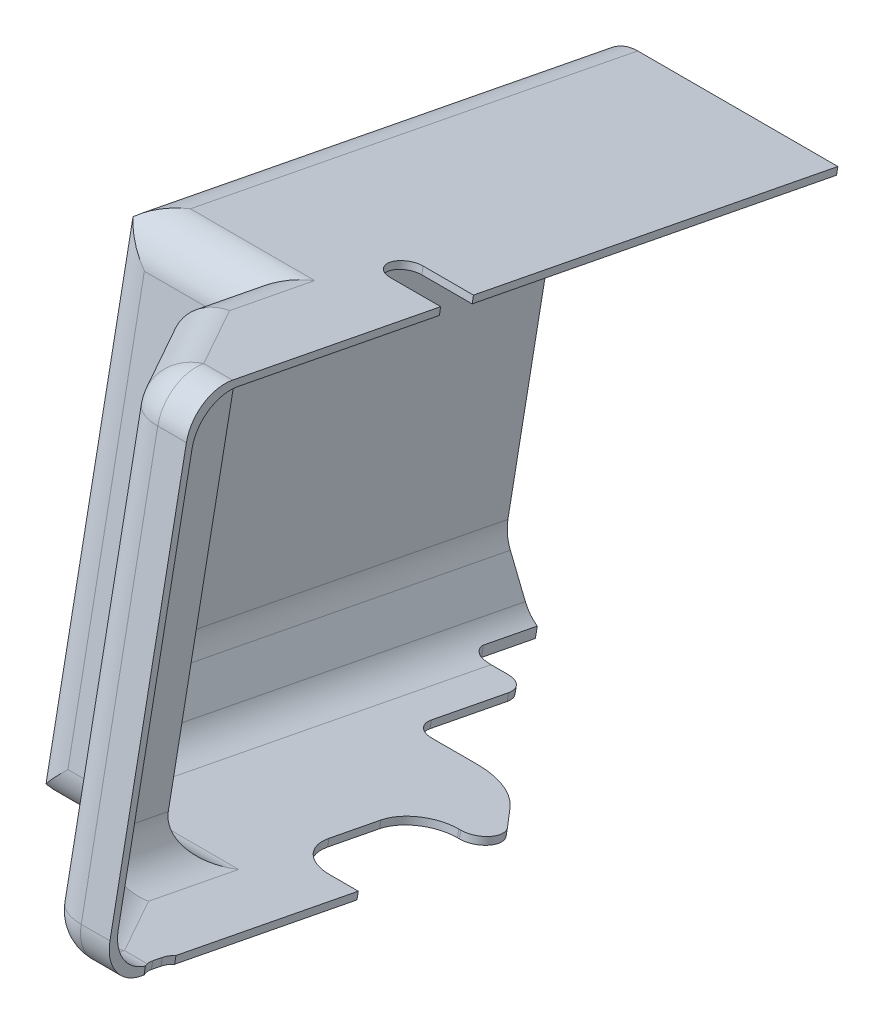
ISO-10303-21;
HEADER;
FILE_DESCRIPTION(('STEP AP214'),'2;1');
FILE_NAME('part.step','',(''),(''),'','','');
FILE_SCHEMA(('AUTOMOTIVE_DESIGN { 1 0 10303 214 1 1 1 1 }'));
ENDSEC;
DATA;
#1=APPLICATION_CONTEXT('core data for automotive mechanical design processes');
#2=APPLICATION_PROTOCOL_DEFINITION('international standard','automotive_design',2000,#1);
#3=PRODUCT_CONTEXT('',#1,'mechanical');
#4=PRODUCT('Part','Part','',(#3));
#5=PRODUCT_RELATED_PRODUCT_CATEGORY('part','',(#4));
#6=PRODUCT_DEFINITION_FORMATION('','',#4);
#7=PRODUCT_DEFINITION_CONTEXT('part definition',#1,'design');
#8=PRODUCT_DEFINITION('design','',#6,#7);
#9=PRODUCT_DEFINITION_SHAPE('','',#8);
#10=(LENGTH_UNIT() NAMED_UNIT(*) SI_UNIT(.MILLI.,.METRE.));
#11=(NAMED_UNIT(*) PLANE_ANGLE_UNIT() SI_UNIT($,.RADIAN.));
#12=(NAMED_UNIT(*) SI_UNIT($,.STERADIAN.) SOLID_ANGLE_UNIT());
#13=UNCERTAINTY_MEASURE_WITH_UNIT(LENGTH_MEASURE(1.E-05),#10,'distance_accuracy_value','');
#14=(GEOMETRIC_REPRESENTATION_CONTEXT(3) GLOBAL_UNCERTAINTY_ASSIGNED_CONTEXT((#13)) GLOBAL_UNIT_ASSIGNED_CONTEXT((#10,
#11,#12)) REPRESENTATION_CONTEXT('',''));
#15=CARTESIAN_POINT('',(0.,0.,0.));
#16=DIRECTION('',(0.,0.,1.));
#17=DIRECTION('',(1.,0.,0.));
#18=AXIS2_PLACEMENT_3D('',#15,#16,#17);
#19=CARTESIAN_POINT('',(-899.788429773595,-181.276923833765,-326.420936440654));
#20=DIRECTION('',(-0.844329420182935,0.102240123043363,0.52597983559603));
#21=DIRECTION('',(0.528750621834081,0.,0.848777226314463));
#22=AXIS2_PLACEMENT_3D('',#19,#20,#21);
#23=PLANE('',#22);
#24=DIRECTION('',(0.,0.981627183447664,-0.190808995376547));
#25=VECTOR('',#24,1.);
#26=CARTESIAN_POINT('',(-899.788429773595,-316.415574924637,-300.152643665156));
#27=LINE('',#26,#25);
#28=CARTESIAN_POINT('',(-899.788429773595,-316.415574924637,-300.152643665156));
#29=VERTEX_POINT('',#28);
#30=CARTESIAN_POINT('',(-899.788429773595,-193.74358906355,-323.997662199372));
#31=VERTEX_POINT('',#30);
#32=EDGE_CURVE('E1298',#29,#31,#27,.T.);
#33=ORIENTED_EDGE('',*,*,#32,.T.);
#34=DIRECTION('',(0.535824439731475,0.161105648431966,0.828816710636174));
#35=VECTOR('',#34,1.);
#36=CARTESIAN_POINT('',(-909.955887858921,-196.800625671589,-339.724752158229));
#37=LINE('',#36,#35);
#38=CARTESIAN_POINT('',(-883.603762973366,-188.877366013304,-298.963114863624));
#39=VERTEX_POINT('',#38);
#40=EDGE_CURVE('E1307',#31,#39,#37,.T.);
#41=ORIENTED_EDGE('',*,*,#40,.T.);
#42=DIRECTION('',(0.,-0.981627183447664,0.190808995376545));
#43=VECTOR('',#42,1.);
#44=CARTESIAN_POINT('',(-883.603762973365,-176.410700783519,-301.386389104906));
#45=LINE('',#44,#43);
#46=CARTESIAN_POINT('',(-883.603762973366,-311.549351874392,-275.118096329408));
#47=VERTEX_POINT('',#46);
#48=EDGE_CURVE('E1306',#39,#47,#45,.T.);
#49=ORIENTED_EDGE('',*,*,#48,.T.);
#50=DIRECTION('',(0.535824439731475,0.161105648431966,0.828816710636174));
#51=VECTOR('',#50,1.);
#52=CARTESIAN_POINT('',(-899.788429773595,-316.415574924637,-300.152643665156));
#53=LINE('',#52,#51);
#54=EDGE_CURVE('E1312',#47,#29,#53,.F.);
#55=ORIENTED_EDGE('',*,*,#54,.T.);
#56=EDGE_LOOP('',(#33,#41,#49,#55));
#57=FACE_BOUND('',#56,.T.);
#58=ADVANCED_FACE('F36',(#57),#23,.F.);
#59=CARTESIAN_POINT('',(-899.788429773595,-185.221300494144,-346.71299522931));
#60=DIRECTION('',(-1.,0.,0.));
#61=DIRECTION('',(0.,-1.,0.));
#62=AXIS2_PLACEMENT_3D('',#59,#60,#61);
#63=PLANE('',#62);
#64=DIRECTION('',(0.,-0.981627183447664,0.190808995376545));
#65=VECTOR('',#64,1.);
#66=CARTESIAN_POINT('',(-899.788429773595,-185.221300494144,-346.71299522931));
#67=LINE('',#66,#65);
#68=CARTESIAN_POINT('',(-899.788429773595,-320.359951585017,-320.444702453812));
#69=VERTEX_POINT('',#68);
#70=CARTESIAN_POINT('',(-899.788429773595,-197.68796572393,-344.289720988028));
#71=VERTEX_POINT('',#70);
#72=EDGE_CURVE('E1301',#69,#71,#67,.F.);
#73=ORIENTED_EDGE('',*,*,#72,.T.);
#74=DIRECTION('',(0.,0.190808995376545,0.981627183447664));
#75=VECTOR('',#74,1.);
#76=CARTESIAN_POINT('',(-899.788429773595,-200.169821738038,-357.057763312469));
#77=LINE('',#76,#75);
#78=EDGE_CURVE('E1303',#71,#31,#77,.T.);
#79=ORIENTED_EDGE('',*,*,#78,.T.);
#80=ORIENTED_EDGE('',*,*,#32,.F.);
#81=DIRECTION('',(0.,0.190808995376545,0.981627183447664));
#82=VECTOR('',#81,1.);
#83=CARTESIAN_POINT('',(-899.788429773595,-318.387763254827,-310.298673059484));
#84=LINE('',#83,#82);
#85=EDGE_CURVE('E1308',#29,#69,#84,.F.);
#86=ORIENTED_EDGE('',*,*,#85,.T.);
#87=EDGE_LOOP('',(#73,#79,#80,#86));
#88=FACE_BOUND('',#87,.T.);
#89=ADVANCED_FACE('F1106',(#88),#63,.F.);
#90=CARTESIAN_POINT('',(-935.140999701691,-185.221300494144,-346.71299522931));
#91=DIRECTION('',(0.,0.190808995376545,0.981627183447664));
#92=DIRECTION('',(0.,-0.981627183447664,0.190808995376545));
#93=AXIS2_PLACEMENT_3D('',#90,#91,#92);
#94=PLANE('',#93);
#95=ORIENTED_EDGE('',*,*,#72,.F.);
#96=DIRECTION('',(1.,0.,0.));
#97=VECTOR('',#96,1.);
#98=CARTESIAN_POINT('',(-917.464714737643,-320.359951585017,-320.444702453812));
#99=LINE('',#98,#97);
#100=CARTESIAN_POINT('',(-935.140999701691,-320.359951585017,-320.444702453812));
#101=VERTEX_POINT('',#100);
#102=EDGE_CURVE('E1315',#69,#101,#99,.F.);
#103=ORIENTED_EDGE('',*,*,#102,.T.);
#104=DIRECTION('',(0.,0.981627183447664,-0.190808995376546));
#105=VECTOR('',#104,1.);
#106=CARTESIAN_POINT('',(-935.140999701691,-320.359951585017,-320.444702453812));
#107=LINE('',#106,#105);
#108=CARTESIAN_POINT('',(-935.140999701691,-197.68796572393,-344.289720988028));
#109=VERTEX_POINT('',#108);
#110=EDGE_CURVE('E980',#101,#109,#107,.T.);
#111=ORIENTED_EDGE('',*,*,#110,.T.);
#112=DIRECTION('',(-1.,0.,0.));
#113=VECTOR('',#112,1.);
#114=CARTESIAN_POINT('',(-916.095266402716,-197.68796572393,-344.289720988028));
#115=LINE('',#114,#113);
#116=EDGE_CURVE('E1317',#109,#71,#115,.F.);
#117=ORIENTED_EDGE('',*,*,#116,.T.);
#118=EDGE_LOOP('',(#95,#103,#111,#117));
#119=FACE_BOUND('',#118,.T.);
#120=ADVANCED_FACE('F1110',(#119),#94,.F.);
#121=CARTESIAN_POINT('',(-936.364429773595,-201.743222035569,-364.496446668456));
#122=DIRECTION('',(0.,-0.981627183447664,0.190808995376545));
#123=DIRECTION('',(0.,-0.190808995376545,-0.981627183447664));
#124=AXIS2_PLACEMENT_3D('',#121,#122,#123);
#125=CYLINDRICAL_SURFACE('',#124,12.7);
#126=DIRECTION('',(0.,-0.981627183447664,0.190808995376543));
#127=VECTOR('',#126,1.);
#128=CARTESIAN_POINT('',(-946.931468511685,-201.124879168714,-357.440094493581));
#129=LINE('',#128,#127);
#130=CARTESIAN_POINT('',(-946.931468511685,-201.124879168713,-357.440094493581));
#131=VERTEX_POINT('',#130);
#132=CARTESIAN_POINT('',(-946.931468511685,-322.099517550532,-333.925006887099));
#133=VERTEX_POINT('',#132);
#134=EDGE_CURVE('E1311',#131,#133,#129,.T.);
#135=ORIENTED_EDGE('',*,*,#134,.F.);
#136=CARTESIAN_POINT('',(-936.364429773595,-209.384331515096,-363.01116544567));
#137=DIRECTION('',(0.,-0.559192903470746,0.829037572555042));
#138=DIRECTION('',(0.,0.829037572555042,0.559192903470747));
#139=AXIS2_PLACEMENT_3D('',#136,#137,#138);
#140=ELLIPSE('',#139,17.9605122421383,12.7);
#141=CARTESIAN_POINT('',(-949.064429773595,-209.384331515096,-363.01116544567));
#142=VERTEX_POINT('',#141);
#143=EDGE_CURVE('E810',#142,#131,#140,.F.);
#144=ORIENTED_EDGE('',*,*,#143,.F.);
#145=DIRECTION('',(0.,0.981627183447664,-0.190808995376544));
#146=VECTOR('',#145,1.);
#147=CARTESIAN_POINT('',(-949.064429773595,-316.528446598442,-342.184459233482));
#148=LINE('',#147,#146);
#149=CARTESIAN_POINT('',(-949.064429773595,-316.528446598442,-342.184459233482));
#150=VERTEX_POINT('',#149);
#151=EDGE_CURVE('E814',#150,#142,#148,.T.);
#152=ORIENTED_EDGE('',*,*,#151,.F.);
#153=CARTESIAN_POINT('',(-936.364429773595,-316.528446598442,-342.184459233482));
#154=DIRECTION('',(0.,-0.829037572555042,-0.559192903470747));
#155=DIRECTION('',(0.,0.559192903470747,-0.829037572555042));
#156=AXIS2_PLACEMENT_3D('',#153,#154,#155);
#157=ELLIPSE('',#156,17.9605122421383,12.7);
#158=EDGE_CURVE('E818',#133,#150,#157,.T.);
#159=ORIENTED_EDGE('',*,*,#158,.F.);
#160=EDGE_LOOP('',(#135,#144,#152,#159));
#161=FACE_BOUND('',#160,.T.);
#162=ADVANCED_FACE('F1114',(#161),#125,.T.);
#163=CARTESIAN_POINT('',(-949.064429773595,-186.176022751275,-363.605182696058));
#164=DIRECTION('',(-0.832050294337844,0.105841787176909,0.544508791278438));
#165=DIRECTION('',(0.547584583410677,0.,0.836750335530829));
#166=AXIS2_PLACEMENT_3D('',#163,#164,#165);
#167=PLANE('',#166);
#168=ORIENTED_EDGE('',*,*,#134,.T.);
#169=DIRECTION('',(-0.426401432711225,0.505809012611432,-0.749892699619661));
#170=VECTOR('',#169,1.);
#171=CARTESIAN_POINT('',(-940.134634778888,-330.162107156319,-321.971726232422));
#172=LINE('',#171,#170);
#173=CARTESIAN_POINT('',(-940.134634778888,-330.162107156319,-321.971726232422));
#174=VERTEX_POINT('',#173);
#175=EDGE_CURVE('E822',#174,#133,#172,.T.);
#176=ORIENTED_EDGE('',*,*,#175,.F.);
#177=DIRECTION('',(0.,-0.981627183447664,0.190808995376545));
#178=VECTOR('',#177,1.);
#179=CARTESIAN_POINT('',(-940.134634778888,-183.620194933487,-350.456588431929));
#180=LINE('',#179,#178);
#181=CARTESIAN_POINT('',(-940.134634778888,-189.171598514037,-349.377504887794));
#182=VERTEX_POINT('',#181);
#183=EDGE_CURVE('E828',#182,#174,#180,.T.);
#184=ORIENTED_EDGE('',*,*,#183,.F.);
#185=DIRECTION('',(0.426401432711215,0.749892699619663,0.505809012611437));
#186=VECTOR('',#185,1.);
#187=CARTESIAN_POINT('',(-946.931468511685,-201.124879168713,-357.440094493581));
#188=LINE('',#187,#186);
#189=EDGE_CURVE('E806',#131,#182,#188,.T.);
#190=ORIENTED_EDGE('',*,*,#189,.F.);
#191=EDGE_LOOP('',(#168,#176,#184,#190));
#192=FACE_BOUND('',#191,.T.);
#193=ADVANCED_FACE('F1118',(#192),#167,.T.);
#194=CARTESIAN_POINT('',(-934.078429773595,-204.146217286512,-364.734451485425));
#195=DIRECTION('',(0.,-0.981627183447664,0.190808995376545));
#196=DIRECTION('',(0.,-0.190808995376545,-0.981627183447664));
#197=AXIS2_PLACEMENT_3D('',#194,#195,#196);
#198=CYLINDRICAL_SURFACE('',#197,12.7);
#199=CARTESIAN_POINT('',(-934.078429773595,-211.760398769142,-363.254404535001));
#200=DIRECTION('',(0.,-0.559192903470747,0.829037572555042));
#201=DIRECTION('',(0.,-0.829037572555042,-0.559192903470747));
#202=AXIS2_PLACEMENT_3D('',#199,#200,#201);
#203=ELLIPSE('',#202,17.9605122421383,12.7);
#204=CARTESIAN_POINT('',(-946.778429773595,-211.760398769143,-363.254404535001));
#205=VERTEX_POINT('',#204);
#206=CARTESIAN_POINT('',(-944.645468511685,-203.50094642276,-357.683333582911));
#207=VERTEX_POINT('',#206);
#208=EDGE_CURVE('E792',#205,#207,#203,.F.);
#209=ORIENTED_EDGE('',*,*,#208,.T.);
#210=DIRECTION('',(0.,-0.981627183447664,0.190808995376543));
#211=VECTOR('',#210,1.);
#212=CARTESIAN_POINT('',(-944.645468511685,-203.500946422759,-357.683333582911));
#213=LINE('',#212,#211);
#214=CARTESIAN_POINT('',(-944.645468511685,-319.987585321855,-335.040624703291));
#215=VERTEX_POINT('',#214);
#216=EDGE_CURVE('E874',#207,#215,#213,.T.);
#217=ORIENTED_EDGE('',*,*,#216,.T.);
#218=CARTESIAN_POINT('',(-934.078429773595,-314.416514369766,-343.300077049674));
#219=DIRECTION('',(0.,-0.829037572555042,-0.559192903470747));
#220=DIRECTION('',(0.,0.559192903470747,-0.829037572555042));
#221=AXIS2_PLACEMENT_3D('',#218,#219,#220);
#222=ELLIPSE('',#221,17.9605122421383,12.7);
#223=CARTESIAN_POINT('',(-946.778429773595,-314.416514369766,-343.300077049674));
#224=VERTEX_POINT('',#223);
#225=EDGE_CURVE('E785',#215,#224,#222,.T.);
#226=ORIENTED_EDGE('',*,*,#225,.T.);
#227=DIRECTION('',(0.,0.981627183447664,-0.190808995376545));
#228=VECTOR('',#227,1.);
#229=CARTESIAN_POINT('',(-946.778429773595,-314.416514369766,-343.300077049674));
#230=LINE('',#229,#228);
#231=EDGE_CURVE('E788',#224,#205,#230,.T.);
#232=ORIENTED_EDGE('',*,*,#231,.T.);
#233=EDGE_LOOP('',(#209,#217,#226,#232));
#234=FACE_BOUND('',#233,.T.);
#235=ADVANCED_FACE('F1122',(#234),#198,.F.);
#236=CARTESIAN_POINT('',(-946.778429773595,-188.552090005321,-363.848421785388));
#237=DIRECTION('',(-0.832050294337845,0.105841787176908,0.544508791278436));
#238=DIRECTION('',(0.547584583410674,0.,0.836750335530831));
#239=AXIS2_PLACEMENT_3D('',#236,#237,#238);
#240=PLANE('',#239);
#241=ORIENTED_EDGE('',*,*,#110,.F.);
#242=CARTESIAN_POINT('',(-943.607666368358,-322.783225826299,-332.911367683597));
#243=DIRECTION('',(-0.832050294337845,0.105841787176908,0.544508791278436));
#244=DIRECTION('',(0.554700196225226,0.158762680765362,0.816763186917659));
#245=AXIS2_PLACEMENT_3D('',#242,#243,#244);
#246=ELLIPSE('',#245,15.2635003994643,12.7);
#247=CARTESIAN_POINT('',(-937.077238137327,-328.84865250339,-321.753384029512));
#248=VERTEX_POINT('',#247);
#249=EDGE_CURVE('E981',#248,#101,#246,.T.);
#250=ORIENTED_EDGE('',*,*,#249,.F.);
#251=CARTESIAN_POINT('',(-927.281596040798,-318.110484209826,-308.87219603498));
#252=DIRECTION('',(-0.832050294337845,0.105841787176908,0.544508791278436));
#253=DIRECTION('',(0.554700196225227,0.158762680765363,0.816763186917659));
#254=AXIS2_PLACEMENT_3D('',#251,#252,#253);
#255=ELLIPSE('',#254,22.8952505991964,12.7);
#256=CARTESIAN_POINT('',(-937.848634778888,-328.050174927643,-323.087344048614));
#257=VERTEX_POINT('',#256);
#258=EDGE_CURVE('E777',#248,#257,#255,.F.);
#259=ORIENTED_EDGE('',*,*,#258,.T.);
#260=DIRECTION('',(-0.426401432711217,0.505809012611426,-0.74989269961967));
#261=VECTOR('',#260,1.);
#262=CARTESIAN_POINT('',(-937.848634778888,-328.050174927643,-323.087344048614));
#263=LINE('',#262,#261);
#264=EDGE_CURVE('E781',#257,#215,#263,.T.);
#265=ORIENTED_EDGE('',*,*,#264,.T.);
#266=ORIENTED_EDGE('',*,*,#216,.F.);
#267=DIRECTION('',(0.426401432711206,0.74989269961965,0.505809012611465));
#268=VECTOR('',#267,1.);
#269=CARTESIAN_POINT('',(-944.645468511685,-203.500946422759,-357.683333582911));
#270=LINE('',#269,#268);
#271=CARTESIAN_POINT('',(-937.848634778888,-191.547665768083,-349.620743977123));
#272=VERTEX_POINT('',#271);
#273=EDGE_CURVE('E795',#207,#272,#270,.T.);
#274=ORIENTED_EDGE('',*,*,#273,.T.);
#275=CARTESIAN_POINT('',(-927.281596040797,-195.438498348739,-332.717214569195));
#276=DIRECTION('',(-0.832050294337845,0.105841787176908,0.544508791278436));
#277=DIRECTION('',(-0.554700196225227,-0.158762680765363,-0.816763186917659));
#278=AXIS2_PLACEMENT_3D('',#275,#276,#277);
#279=ELLIPSE('',#278,22.8952505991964,12.7);
#280=CARTESIAN_POINT('',(-937.077238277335,-190.30762019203,-348.683032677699));
#281=VERTEX_POINT('',#280);
#282=EDGE_CURVE('E947',#272,#281,#279,.F.);
#283=ORIENTED_EDGE('',*,*,#282,.T.);
#284=CARTESIAN_POINT('',(-943.607666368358,-200.111239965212,-356.756386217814));
#285=DIRECTION('',(-0.832050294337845,0.105841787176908,0.544508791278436));
#286=DIRECTION('',(-0.554700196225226,-0.158762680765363,-0.816763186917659));
#287=AXIS2_PLACEMENT_3D('',#284,#285,#286);
#288=ELLIPSE('',#287,15.2635003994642,12.7);
#289=EDGE_CURVE('E978',#109,#281,#288,.T.);
#290=ORIENTED_EDGE('',*,*,#289,.F.);
#291=EDGE_LOOP('',(#241,#250,#259,#265,#266,#274,#283,#290));
#292=FACE_BOUND('',#291,.T.);
#293=ADVANCED_FACE('F1126',(#292),#240,.F.);
#294=CARTESIAN_POINT('',(-872.880779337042,-190.175815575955,-305.643058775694));
#295=DIRECTION('',(0.,-0.981627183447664,0.190808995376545));
#296=DIRECTION('',(0.,-0.190808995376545,-0.981627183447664));
#297=AXIS2_PLACEMENT_3D('',#294,#295,#296);
#298=CYLINDRICAL_SURFACE('',#297,12.7);
#299=CARTESIAN_POINT('',(-872.880779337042,-190.175815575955,-305.643058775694));
#300=DIRECTION('',(0.,-0.981627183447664,0.190808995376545));
#301=DIRECTION('',(0.,-0.190808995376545,-0.981627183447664));
#302=AXIS2_PLACEMENT_3D('',#299,#300,#301);
#303=CIRCLE('',#302,12.7);
#304=CARTESIAN_POINT('',(-872.880779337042,-187.752541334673,-293.176393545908));
#305=VERTEX_POINT('',#304);
#306=EDGE_CURVE('E976',#39,#305,#303,.F.);
#307=ORIENTED_EDGE('',*,*,#306,.T.);
#308=DIRECTION('',(0.,-0.981627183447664,0.190808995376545));
#309=VECTOR('',#308,1.);
#310=CARTESIAN_POINT('',(-872.880779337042,-175.285876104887,-295.59966778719));
#311=LINE('',#310,#309);
#312=CARTESIAN_POINT('',(-872.880779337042,-310.424527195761,-269.331375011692));
#313=VERTEX_POINT('',#312);
#314=EDGE_CURVE('E771',#305,#313,#311,.T.);
#315=ORIENTED_EDGE('',*,*,#314,.T.);
#316=CARTESIAN_POINT('',(-872.880779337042,-312.847801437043,-281.798040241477));
#317=DIRECTION('',(0.,-0.981627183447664,0.190808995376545));
#318=DIRECTION('',(0.,-0.190808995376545,-0.981627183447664));
#319=AXIS2_PLACEMENT_3D('',#316,#317,#318);
#320=CIRCLE('',#319,12.7);
#321=EDGE_CURVE('E966',#313,#47,#320,.T.);
#322=ORIENTED_EDGE('',*,*,#321,.T.);
#323=ORIENTED_EDGE('',*,*,#48,.F.);
#324=EDGE_LOOP('',(#307,#315,#322,#323));
#325=FACE_BOUND('',#324,.T.);
#326=ADVANCED_FACE('F1130',(#325),#298,.F.);
#327=CARTESIAN_POINT('',(-872.880779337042,-190.175815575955,-305.643058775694));
#328=DIRECTION('',(0.489945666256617,0.734312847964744,0.469827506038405));
#329=DIRECTION('',(-0.7888910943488,0.144139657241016,0.597389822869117));
#330=AXIS2_PLACEMENT_3D('',#327,#328,#329);
#331=SPHERICAL_SURFACE('',#330,12.7);
#332=ORIENTED_EDGE('',*,*,#306,.F.);
#333=CARTESIAN_POINT('',(-872.880779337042,-190.175815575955,-305.643058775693));
#334=DIRECTION('',(0.535824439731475,0.161105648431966,0.828816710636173));
#335=DIRECTION('',(0.83978670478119,0.,-0.542916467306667));
#336=AXIS2_PLACEMENT_3D('',#333,#334,#335);
#337=CIRCLE('',#336,12.7);
#338=CARTESIAN_POINT('',(-872.880779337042,-177.70915034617,-308.066333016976));
#339=VERTEX_POINT('',#338);
#340=EDGE_CURVE('E973',#39,#339,#337,.F.);
#341=ORIENTED_EDGE('',*,*,#340,.T.);
#342=CARTESIAN_POINT('',(-872.880779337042,-190.175815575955,-305.643058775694));
#343=DIRECTION('',(1.,0.,0.));
#344=DIRECTION('',(0.,1.,0.));
#345=AXIS2_PLACEMENT_3D('',#342,#343,#344);
#346=CIRCLE('',#345,12.7);
#347=EDGE_CURVE('E767',#339,#305,#346,.T.);
#348=ORIENTED_EDGE('',*,*,#347,.T.);
#349=EDGE_LOOP('',(#332,#341,#348));
#350=FACE_BOUND('',#349,.T.);
#351=ADVANCED_FACE('F1134',(#350),#331,.F.);
#352=CARTESIAN_POINT('',(-888.580025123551,-194.89608771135,-329.926753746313));
#353=DIRECTION('',(0.535824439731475,0.161105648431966,0.828816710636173));
#354=DIRECTION('',(0.83978670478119,0.,-0.542916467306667));
#355=AXIS2_PLACEMENT_3D('',#352,#353,#354);
#356=CYLINDRICAL_SURFACE('',#355,12.7);
#357=CARTESIAN_POINT('',(-887.088429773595,-194.44761164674,-327.619544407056));
#358=DIRECTION('',(0.278989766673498,0.183232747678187,0.942650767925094));
#359=DIRECTION('',(-0.960294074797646,0.0532337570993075,0.273863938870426));
#360=AXIS2_PLACEMENT_3D('',#357,#358,#359);
#361=ELLIPSE('',#360,13.2251154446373,12.7);
#362=CARTESIAN_POINT('',(-887.088429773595,-181.980946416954,-330.042818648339));
#363=VERTEX_POINT('',#362);
#364=EDGE_CURVE('E971',#31,#363,#361,.F.);
#365=ORIENTED_EDGE('',*,*,#364,.T.);
#366=DIRECTION('',(-0.535824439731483,-0.161105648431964,-0.828816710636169));
#367=VECTOR('',#366,1.);
#368=CARTESIAN_POINT('',(-872.880779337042,-177.709150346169,-308.066333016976));
#369=LINE('',#368,#367);
#370=EDGE_CURVE('E762',#339,#363,#369,.T.);
#371=ORIENTED_EDGE('',*,*,#370,.F.);
#372=ORIENTED_EDGE('',*,*,#340,.F.);
#373=ORIENTED_EDGE('',*,*,#40,.F.);
#374=EDGE_LOOP('',(#365,#371,#372,#373));
#375=FACE_BOUND('',#374,.T.);
#376=ADVANCED_FACE('F1139',(#375),#356,.F.);
#377=CARTESIAN_POINT('',(-887.088429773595,-200.148208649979,-356.946573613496));
#378=DIRECTION('',(0.,0.190808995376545,0.981627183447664));
#379=DIRECTION('',(0.,-0.981627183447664,0.190808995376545));
#380=AXIS2_PLACEMENT_3D('',#377,#378,#379);
#381=CYLINDRICAL_SURFACE('',#380,12.7);
#382=CARTESIAN_POINT('',(-887.088429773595,-200.111239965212,-356.756386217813));
#383=DIRECTION('',(0.707106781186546,0.134922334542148,0.694115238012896));
#384=DIRECTION('',(-0.707106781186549,0.134922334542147,0.694115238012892));
#385=AXIS2_PLACEMENT_3D('',#382,#383,#384);
#386=ELLIPSE('',#385,17.9605122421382,12.7);
#387=CARTESIAN_POINT('',(-887.088429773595,-187.644574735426,-359.179660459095));
#388=VERTEX_POINT('',#387);
#389=EDGE_CURVE('E859',#71,#388,#386,.F.);
#390=ORIENTED_EDGE('',*,*,#389,.T.);
#391=DIRECTION('',(0.,-0.190808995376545,-0.981627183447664));
#392=VECTOR('',#391,1.);
#393=CARTESIAN_POINT('',(-887.088429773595,-190.18501252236,-372.249079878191));
#394=LINE('',#393,#392);
#395=EDGE_CURVE('E862',#363,#388,#394,.T.);
#396=ORIENTED_EDGE('',*,*,#395,.F.);
#397=ORIENTED_EDGE('',*,*,#364,.F.);
#398=ORIENTED_EDGE('',*,*,#78,.F.);
#399=EDGE_LOOP('',(#390,#396,#397,#398));
#400=FACE_BOUND('',#399,.T.);
#401=ADVANCED_FACE('F1472',(#400),#381,.F.);
#402=CARTESIAN_POINT('',(-886.793389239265,-200.111239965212,-356.756386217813));
#403=DIRECTION('',(-1.,0.,0.));
#404=DIRECTION('',(0.,0.,1.));
#405=AXIS2_PLACEMENT_3D('',#402,#403,#404);
#406=CYLINDRICAL_SURFACE('',#405,12.7);
#407=CARTESIAN_POINT('',(-927.281596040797,-200.111239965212,-356.756386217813));
#408=DIRECTION('',(-0.707106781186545,-0.134922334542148,-0.694115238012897));
#409=DIRECTION('',(0.70710678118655,-0.134922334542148,-0.694115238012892));
#410=AXIS2_PLACEMENT_3D('',#407,#408,#409);
#411=ELLIPSE('',#410,17.9605122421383,12.7);
#412=CARTESIAN_POINT('',(-936.261852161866,-189.582462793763,-349.654636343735));
#413=VERTEX_POINT('',#412);
#414=CARTESIAN_POINT('',(-927.281596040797,-187.644574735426,-359.179660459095));
#415=VERTEX_POINT('',#414);
#416=EDGE_CURVE('E945',#413,#415,#411,.T.);
#417=ORIENTED_EDGE('',*,*,#416,.T.);
#418=DIRECTION('',(1.,0.,0.));
#419=VECTOR('',#418,1.);
#420=CARTESIAN_POINT('',(-897.04953310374,-187.644574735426,-359.179660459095));
#421=LINE('',#420,#419);
#422=EDGE_CURVE('E799',#388,#415,#421,.F.);
#423=ORIENTED_EDGE('',*,*,#422,.F.);
#424=ORIENTED_EDGE('',*,*,#389,.F.);
#425=ORIENTED_EDGE('',*,*,#116,.F.);
#426=ORIENTED_EDGE('',*,*,#289,.T.);
#427=CARTESIAN_POINT('',(-937.077238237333,-190.307620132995,-348.683032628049));
#428=CARTESIAN_POINT('',(-937.045416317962,-190.275836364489,-348.721628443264));
#429=CARTESIAN_POINT('',(-937.013432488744,-190.244346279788,-348.760332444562));
#430=CARTESIAN_POINT('',(-936.94889851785,-190.181707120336,-348.838251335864));
#431=CARTESIAN_POINT('',(-936.916345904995,-190.150562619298,-348.877467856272));
#432=CARTESIAN_POINT('',(-936.850673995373,-190.08862395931,-348.956409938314));
#433=CARTESIAN_POINT('',(-936.817552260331,-190.057834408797,-348.996137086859));
#434=CARTESIAN_POINT('',(-936.750741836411,-189.996615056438,-349.076098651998));
#435=CARTESIAN_POINT('',(-936.717050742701,-189.966189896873,-349.116334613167));
#436=CARTESIAN_POINT('',(-936.649101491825,-189.905708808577,-349.197311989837));
#437=CARTESIAN_POINT('',(-936.614840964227,-189.875657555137,-349.238054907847));
#438=CARTESIAN_POINT('',(-936.545752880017,-189.81593383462,-349.32004438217));
#439=CARTESIAN_POINT('',(-936.510922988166,-189.78626607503,-349.361292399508));
#440=CARTESIAN_POINT('',(-936.440696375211,-189.727318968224,-349.44429021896));
#441=CARTESIAN_POINT('',(-936.405297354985,-189.69804435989,-349.486041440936));
#442=CARTESIAN_POINT('',(-936.333932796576,-189.639893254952,-349.570043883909));
#443=CARTESIAN_POINT('',(-936.29796499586,-189.611021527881,-349.612296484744));
#444=CARTESIAN_POINT('',(-936.261852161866,-189.582462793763,-349.654636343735));
#445=B_SPLINE_CURVE_WITH_KNOTS('',3,(#427,#428,#429,#430,#431,#432,#433,#434,#435,#436,#437,
#438,#439,#440,#441,#442,#443,#444),.UNSPECIFIED.,.F.,.F.,(4,2,2,2,2,2,2,2,4),(0.,
0.177797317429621,0.356981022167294,0.537558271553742,0.719536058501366,0.90292121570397,
1.08772041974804,1.27394019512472,1.46158691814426),.UNSPECIFIED.);
#446=EDGE_CURVE('E892',#281,#413,#445,.T.);
#447=ORIENTED_EDGE('',*,*,#446,.T.);
#448=EDGE_LOOP('',(#417,#423,#424,#425,#426,#447));
#449=FACE_BOUND('',#448,.T.);
#450=ADVANCED_FACE('F1345',(#449),#406,.F.);
#451=CARTESIAN_POINT('',(-839.209429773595,-190.17442524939,-384.175180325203));
#452=DIRECTION('',(0.,-0.190808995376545,-0.981627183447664));
#453=DIRECTION('',(0.,0.981627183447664,-0.190808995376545));
#454=AXIS2_PLACEMENT_3D('',#451,#452,#453);
#455=PLANE('',#454);
#456=DIRECTION('',(1.,0.,0.));
#457=VECTOR('',#456,1.);
#458=CARTESIAN_POINT('',(-897.04953310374,-192.418424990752,-383.738990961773));
#459=LINE('',#458,#457);
#460=CARTESIAN_POINT('',(-864.863429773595,-192.418424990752,-383.738990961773));
#461=VERTEX_POINT('',#460);
#462=CARTESIAN_POINT('',(-881.119429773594,-192.418424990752,-383.738990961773));
#463=VERTEX_POINT('',#462);
#464=EDGE_CURVE('E899',#461,#463,#459,.F.);
#465=ORIENTED_EDGE('',*,*,#464,.F.);
#466=DIRECTION('',(0.,0.981627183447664,-0.190808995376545));
#467=VECTOR('',#466,1.);
#468=CARTESIAN_POINT('',(-864.863429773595,-190.17442524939,-384.175180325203));
#469=LINE('',#468,#467);
#470=CARTESIAN_POINT('',(-864.863429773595,-190.17442524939,-384.175180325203));
#471=VERTEX_POINT('',#470);
#472=EDGE_CURVE('E1302',#461,#471,#469,.T.);
#473=ORIENTED_EDGE('',*,*,#472,.T.);
#474=DIRECTION('',(1.,0.,0.));
#475=VECTOR('',#474,1.);
#476=CARTESIAN_POINT('',(-898.502554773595,-190.17442524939,-384.175180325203));
#477=LINE('',#476,#475);
#478=CARTESIAN_POINT('',(-881.119429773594,-190.17442524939,-384.175180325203));
#479=VERTEX_POINT('',#478);
#480=EDGE_CURVE('E454',#471,#479,#477,.F.);
#481=ORIENTED_EDGE('',*,*,#480,.T.);
#482=DIRECTION('',(0.,-0.981627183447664,0.190808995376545));
#483=VECTOR('',#482,1.);
#484=CARTESIAN_POINT('',(-881.119429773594,-190.174425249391,-384.175180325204));
#485=LINE('',#484,#483);
#486=EDGE_CURVE('E856',#479,#463,#485,.T.);
#487=ORIENTED_EDGE('',*,*,#486,.T.);
#488=EDGE_LOOP('',(#465,#473,#481,#487));
#489=FACE_BOUND('',#488,.T.);
#490=ADVANCED_FACE('F1403',(#489),#455,.F.);
#491=CARTESIAN_POINT('',(-881.119429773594,-189.144533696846,-378.876847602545));
#492=DIRECTION('',(0.,-0.981627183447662,0.190808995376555));
#493=DIRECTION('',(0.,-0.190808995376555,-0.981627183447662));
#494=AXIS2_PLACEMENT_3D('',#491,#492,#493);
#495=CYLINDRICAL_SURFACE('',#494,5.39749999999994);
#496=CARTESIAN_POINT('',(-881.119429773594,-189.144533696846,-378.876847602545));
#497=DIRECTION('',(0.,-0.981627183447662,0.190808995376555));
#498=DIRECTION('',(0.,-0.190808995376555,-0.981627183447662));
#499=AXIS2_PLACEMENT_3D('',#496,#497,#498);
#500=CIRCLE('',#499,5.39749999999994);
#501=CARTESIAN_POINT('',(-881.119429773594,-188.114642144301,-373.578514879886));
#502=VERTEX_POINT('',#501);
#503=EDGE_CURVE('E903',#479,#502,#500,.F.);
#504=ORIENTED_EDGE('',*,*,#503,.T.);
#505=DIRECTION('',(0.,-0.981627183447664,0.190808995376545));
#506=VECTOR('',#505,1.);
#507=CARTESIAN_POINT('',(-881.119429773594,-188.114642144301,-373.578514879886));
#508=LINE('',#507,#506);
#509=CARTESIAN_POINT('',(-881.119429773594,-190.358641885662,-373.142325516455));
#510=VERTEX_POINT('',#509);
#511=EDGE_CURVE('E853',#502,#510,#508,.T.);
#512=ORIENTED_EDGE('',*,*,#511,.T.);
#513=CARTESIAN_POINT('',(-881.119429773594,-191.388533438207,-378.440658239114));
#514=DIRECTION('',(0.,-0.981627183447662,0.190808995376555));
#515=DIRECTION('',(0.,-0.190808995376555,-0.981627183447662));
#516=AXIS2_PLACEMENT_3D('',#513,#514,#515);
#517=CIRCLE('',#516,5.39749999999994);
#518=EDGE_CURVE('E898',#463,#510,#517,.F.);
#519=ORIENTED_EDGE('',*,*,#518,.F.);
#520=ORIENTED_EDGE('',*,*,#486,.F.);
#521=EDGE_LOOP('',(#504,#512,#519,#520));
#522=FACE_BOUND('',#521,.T.);
#523=ADVANCED_FACE('F1448',(#522),#495,.F.);
#524=CARTESIAN_POINT('',(-881.119429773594,-188.114642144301,-373.578514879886));
#525=DIRECTION('',(0.,0.190808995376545,0.981627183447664));
#526=DIRECTION('',(0.,-0.981627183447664,0.190808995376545));
#527=AXIS2_PLACEMENT_3D('',#524,#525,#526);
#528=PLANE('',#527);
#529=DIRECTION('',(1.,0.,0.));
#530=VECTOR('',#529,1.);
#531=CARTESIAN_POINT('',(-898.502554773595,-188.1146421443,-373.578514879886));
#532=LINE('',#531,#530);
#533=CARTESIAN_POINT('',(-864.863429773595,-188.1146421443,-373.578514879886));
#534=VERTEX_POINT('',#533);
#535=EDGE_CURVE('E849',#502,#534,#532,.T.);
#536=ORIENTED_EDGE('',*,*,#535,.T.);
#537=DIRECTION('',(0.,-0.981627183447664,0.190808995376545));
#538=VECTOR('',#537,1.);
#539=CARTESIAN_POINT('',(-864.863429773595,-188.114642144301,-373.578514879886));
#540=LINE('',#539,#538);
#541=CARTESIAN_POINT('',(-864.863429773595,-190.358641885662,-373.142325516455));
#542=VERTEX_POINT('',#541);
#543=EDGE_CURVE('E1395',#534,#542,#540,.T.);
#544=ORIENTED_EDGE('',*,*,#543,.T.);
#545=DIRECTION('',(1.,0.,0.));
#546=VECTOR('',#545,1.);
#547=CARTESIAN_POINT('',(-897.04953310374,-190.358641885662,-373.142325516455));
#548=LINE('',#547,#546);
#549=EDGE_CURVE('E763',#510,#542,#548,.T.);
#550=ORIENTED_EDGE('',*,*,#549,.F.);
#551=ORIENTED_EDGE('',*,*,#511,.F.);
#552=EDGE_LOOP('',(#536,#544,#550,#551));
#553=FACE_BOUND('',#552,.T.);
#554=ADVANCED_FACE('F1443',(#553),#528,.F.);
#555=CARTESIAN_POINT('',(-889.079389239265,-197.431050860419,-354.948575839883));
#556=DIRECTION('',(-1.,0.,0.));
#557=DIRECTION('',(0.,0.,1.));
#558=AXIS2_PLACEMENT_3D('',#555,#556,#557);
#559=CYLINDRICAL_SURFACE('',#558,12.7);
#560=CARTESIAN_POINT('',(-929.567596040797,-197.431050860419,-354.948575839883));
#561=DIRECTION('',(-0.707106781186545,-0.134922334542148,-0.694115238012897));
#562=DIRECTION('',(0.70710678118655,-0.134922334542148,-0.694115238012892));
#563=AXIS2_PLACEMENT_3D('',#560,#561,#562);
#564=ELLIPSE('',#563,17.9605122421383,12.7);
#565=CARTESIAN_POINT('',(-938.547852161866,-186.90227368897,-347.846825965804));
#566=VERTEX_POINT('',#565);
#567=CARTESIAN_POINT('',(-929.567596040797,-184.964385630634,-357.371850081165));
#568=VERTEX_POINT('',#567);
#569=EDGE_CURVE('E950',#566,#568,#564,.T.);
#570=ORIENTED_EDGE('',*,*,#569,.F.);
#571=CARTESIAN_POINT('',(-929.567596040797,-197.431050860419,-354.948575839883));
#572=DIRECTION('',(-0.707106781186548,-0.694115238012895,0.134922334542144));
#573=DIRECTION('',(0.707106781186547,-0.694115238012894,0.134922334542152));
#574=AXIS2_PLACEMENT_3D('',#571,#572,#573);
#575=ELLIPSE('',#574,17.9605122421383,12.7);
#576=CARTESIAN_POINT('',(-929.567596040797,-195.007776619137,-342.481910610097));
#577=VERTEX_POINT('',#576);
#578=EDGE_CURVE('E831',#577,#566,#575,.T.);
#579=ORIENTED_EDGE('',*,*,#578,.F.);
#580=DIRECTION('',(1.,0.,0.));
#581=VECTOR('',#580,1.);
#582=CARTESIAN_POINT('',(-936.364429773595,-195.007776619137,-342.481910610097));
#583=LINE('',#582,#581);
#584=CARTESIAN_POINT('',(-902.074429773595,-195.007776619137,-342.481910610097));
#585=VERTEX_POINT('',#584);
#586=EDGE_CURVE('E835',#585,#577,#583,.F.);
#587=ORIENTED_EDGE('',*,*,#586,.F.);
#588=CARTESIAN_POINT('',(-889.374429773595,-197.431050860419,-354.948575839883));
#589=DIRECTION('',(-0.707106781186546,-0.134922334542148,-0.694115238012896));
#590=DIRECTION('',(-0.707106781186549,0.134922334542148,0.694115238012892));
#591=AXIS2_PLACEMENT_3D('',#588,#589,#590);
#592=ELLIPSE('',#591,17.9605122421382,12.7);
#593=CARTESIAN_POINT('',(-889.374429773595,-184.964385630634,-357.371850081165));
#594=VERTEX_POINT('',#593);
#595=EDGE_CURVE('E855',#594,#585,#592,.F.);
#596=ORIENTED_EDGE('',*,*,#595,.F.);
#597=DIRECTION('',(1.,0.,0.));
#598=VECTOR('',#597,1.);
#599=CARTESIAN_POINT('',(-898.502554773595,-184.964385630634,-357.371850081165));
#600=LINE('',#599,#598);
#601=EDGE_CURVE('E801',#594,#568,#600,.F.);
#602=ORIENTED_EDGE('',*,*,#601,.T.);
#603=EDGE_LOOP('',(#570,#579,#587,#596,#602));
#604=FACE_BOUND('',#603,.T.);
#605=ADVANCED_FACE('F1378',(#604),#559,.T.);
#606=CARTESIAN_POINT('',(-889.374429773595,-195.743605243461,-346.267420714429));
#607=DIRECTION('',(0.,0.190808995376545,0.981627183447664));
#608=DIRECTION('',(0.,-0.981627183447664,0.190808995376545));
#609=AXIS2_PLACEMENT_3D('',#606,#607,#608);
#610=CYLINDRICAL_SURFACE('',#609,12.7);
#611=DIRECTION('',(0.,-0.190808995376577,-0.981627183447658));
#612=VECTOR('',#611,1.);
#613=CARTESIAN_POINT('',(-902.074429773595,-191.372865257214,-323.78191276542));
#614=LINE('',#613,#612);
#615=CARTESIAN_POINT('',(-902.074429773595,-191.372865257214,-323.78191276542));
#616=VERTEX_POINT('',#615);
#617=EDGE_CURVE('E753',#616,#585,#614,.T.);
#618=ORIENTED_EDGE('',*,*,#617,.F.);
#619=CARTESIAN_POINT('',(-889.374429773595,-192.076887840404,-327.403794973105));
#620=DIRECTION('',(0.278989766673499,0.183232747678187,0.942650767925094));
#621=DIRECTION('',(0.960294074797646,-0.0532337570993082,-0.273863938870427));
#622=AXIS2_PLACEMENT_3D('',#619,#620,#621);
#623=ELLIPSE('',#622,13.2251154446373,12.7);
#624=CARTESIAN_POINT('',(-889.374429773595,-179.610222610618,-329.827069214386));
#625=VERTEX_POINT('',#624);
#626=EDGE_CURVE('E756',#625,#616,#623,.T.);
#627=ORIENTED_EDGE('',*,*,#626,.F.);
#628=DIRECTION('',(0.,-0.190808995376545,-0.981627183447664));
#629=VECTOR('',#628,1.);
#630=CARTESIAN_POINT('',(-889.374429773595,-187.690569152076,-371.396848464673));
#631=LINE('',#630,#629);
#632=EDGE_CURVE('E848',#625,#594,#631,.T.);
#633=ORIENTED_EDGE('',*,*,#632,.T.);
#634=ORIENTED_EDGE('',*,*,#595,.T.);
#635=EDGE_LOOP('',(#618,#627,#633,#634));
#636=FACE_BOUND('',#635,.T.);
#637=ADVANCED_FACE('F1154',(#636),#610,.T.);
#638=CARTESIAN_POINT('',(-872.880779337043,-312.847801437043,-281.798040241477));
#639=DIRECTION('',(0.489945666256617,0.734312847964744,0.469827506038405));
#640=DIRECTION('',(-0.7888910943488,0.144139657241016,0.597389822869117));
#641=AXIS2_PLACEMENT_3D('',#638,#639,#640);
#642=SPHERICAL_SURFACE('',#641,12.7);
#643=ORIENTED_EDGE('',*,*,#321,.F.);
#644=CARTESIAN_POINT('',(-872.880779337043,-312.847801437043,-281.798040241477));
#645=DIRECTION('',(1.,0.,0.));
#646=DIRECTION('',(0.,0.,-1.));
#647=AXIS2_PLACEMENT_3D('',#644,#645,#646);
#648=CIRCLE('',#647,12.7);
#649=CARTESIAN_POINT('',(-872.880779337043,-325.314466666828,-279.374766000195));
#650=VERTEX_POINT('',#649);
#651=EDGE_CURVE('E907',#313,#650,#648,.T.);
#652=ORIENTED_EDGE('',*,*,#651,.T.);
#653=CARTESIAN_POINT('',(-872.880779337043,-312.847801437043,-281.798040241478));
#654=DIRECTION('',(0.535824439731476,0.161105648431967,0.828816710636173));
#655=DIRECTION('',(0.83978670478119,0.,-0.542916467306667));
#656=AXIS2_PLACEMENT_3D('',#653,#654,#655);
#657=CIRCLE('',#656,12.7);
#658=EDGE_CURVE('E963',#650,#47,#657,.F.);
#659=ORIENTED_EDGE('',*,*,#658,.T.);
#660=EDGE_LOOP('',(#643,#652,#659));
#661=FACE_BOUND('',#660,.T.);
#662=ADVANCED_FACE('F1149',(#661),#642,.F.);
#663=CARTESIAN_POINT('',(-888.580025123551,-317.568073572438,-306.081735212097));
#664=DIRECTION('',(0.535824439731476,0.161105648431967,0.828816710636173));
#665=DIRECTION('',(0.83978670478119,0.,-0.542916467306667));
#666=AXIS2_PLACEMENT_3D('',#663,#664,#665);
#667=CYLINDRICAL_SURFACE('',#666,12.7);
#668=ORIENTED_EDGE('',*,*,#658,.F.);
#669=DIRECTION('',(-0.535824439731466,-0.161105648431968,-0.828816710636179));
#670=VECTOR('',#669,1.);
#671=CARTESIAN_POINT('',(-872.880779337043,-325.314466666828,-279.374766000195));
#672=LINE('',#671,#670);
#673=CARTESIAN_POINT('',(-887.088429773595,-329.586262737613,-301.351251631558));
#674=VERTEX_POINT('',#673);
#675=EDGE_CURVE('E839',#650,#674,#672,.T.);
#676=ORIENTED_EDGE('',*,*,#675,.T.);
#677=CARTESIAN_POINT('',(-887.088429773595,-317.119597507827,-303.77452587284));
#678=DIRECTION('',(0.278989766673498,0.183232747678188,0.942650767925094));
#679=DIRECTION('',(0.960294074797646,-0.0532337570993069,-0.273863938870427));
#680=AXIS2_PLACEMENT_3D('',#677,#678,#679);
#681=ELLIPSE('',#680,13.2251154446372,12.7);
#682=EDGE_CURVE('E961',#674,#29,#681,.F.);
#683=ORIENTED_EDGE('',*,*,#682,.T.);
#684=ORIENTED_EDGE('',*,*,#54,.F.);
#685=EDGE_LOOP('',(#668,#676,#683,#684));
#686=FACE_BOUND('',#685,.T.);
#687=ADVANCED_FACE('F1153',(#686),#667,.F.);
#688=CARTESIAN_POINT('',(-887.088429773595,-322.820194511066,-333.10155507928));
#689=DIRECTION('',(0.,0.190808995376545,0.981627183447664));
#690=DIRECTION('',(0.,-0.981627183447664,0.190808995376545));
#691=AXIS2_PLACEMENT_3D('',#688,#689,#690);
#692=CYLINDRICAL_SURFACE('',#691,12.7);
#693=ORIENTED_EDGE('',*,*,#682,.F.);
#694=DIRECTION('',(0.,-0.190808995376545,-0.981627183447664));
#695=VECTOR('',#694,1.);
#696=CARTESIAN_POINT('',(-887.088429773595,-328.882240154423,-297.729369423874));
#697=LINE('',#696,#695);
#698=CARTESIAN_POINT('',(-887.088429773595,-335.249891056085,-330.488093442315));
#699=VERTEX_POINT('',#698);
#700=EDGE_CURVE('E837',#674,#699,#697,.T.);
#701=ORIENTED_EDGE('',*,*,#700,.T.);
#702=CARTESIAN_POINT('',(-887.088429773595,-322.783225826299,-332.911367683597));
#703=DIRECTION('',(0.707106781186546,0.134922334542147,0.694115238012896));
#704=DIRECTION('',(-0.707106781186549,0.134922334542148,0.694115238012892));
#705=AXIS2_PLACEMENT_3D('',#702,#703,#704);
#706=ELLIPSE('',#705,17.9605122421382,12.7);
#707=EDGE_CURVE('E844',#699,#69,#706,.F.);
#708=ORIENTED_EDGE('',*,*,#707,.T.);
#709=ORIENTED_EDGE('',*,*,#85,.F.);
#710=EDGE_LOOP('',(#693,#701,#708,#709));
#711=FACE_BOUND('',#710,.T.);
#712=ADVANCED_FACE('F1159',(#711),#692,.F.);
#713=CARTESIAN_POINT('',(-936.556892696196,-322.783225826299,-332.911367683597));
#714=DIRECTION('',(1.,0.,0.));
#715=DIRECTION('',(0.,0.,-1.));
#716=AXIS2_PLACEMENT_3D('',#713,#714,#715);
#717=CYLINDRICAL_SURFACE('',#716,12.7);
#718=ORIENTED_EDGE('',*,*,#707,.F.);
#719=DIRECTION('',(1.,0.,0.));
#720=VECTOR('',#719,1.);
#721=CARTESIAN_POINT('',(-899.788429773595,-335.249891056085,-330.488093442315));
#722=LINE('',#721,#720);
#723=CARTESIAN_POINT('',(-927.281596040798,-335.249891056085,-330.488093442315));
#724=VERTEX_POINT('',#723);
#725=EDGE_CURVE('E745',#699,#724,#722,.F.);
#726=ORIENTED_EDGE('',*,*,#725,.T.);
#727=CARTESIAN_POINT('',(-927.281596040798,-322.783225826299,-332.911367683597));
#728=DIRECTION('',(0.707106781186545,0.134922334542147,0.694115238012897));
#729=DIRECTION('',(0.70710678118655,-0.134922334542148,-0.694115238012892));
#730=AXIS2_PLACEMENT_3D('',#727,#728,#729);
#731=ELLIPSE('',#730,17.9605122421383,12.7);
#732=CARTESIAN_POINT('',(-936.261852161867,-329.884975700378,-322.382590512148));
#733=VERTEX_POINT('',#732);
#734=EDGE_CURVE('E752',#724,#733,#731,.F.);
#735=ORIENTED_EDGE('',*,*,#734,.T.);
#736=CARTESIAN_POINT('',(-936.261852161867,-329.884975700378,-322.382590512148));
#737=CARTESIAN_POINT('',(-936.297964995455,-329.84263571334,-322.354031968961));
#738=CARTESIAN_POINT('',(-936.333932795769,-329.800038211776,-322.325671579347));
#739=CARTESIAN_POINT('',(-936.405297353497,-329.714653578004,-322.269569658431));
#740=CARTESIAN_POINT('',(-936.440696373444,-329.671870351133,-322.24182506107));
#741=CARTESIAN_POINT('',(-936.510922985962,-329.586124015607,-322.186952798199));
#742=CARTESIAN_POINT('',(-936.545752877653,-329.543164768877,-322.159822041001));
#743=CARTESIAN_POINT('',(-936.61484096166,-329.457076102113,-322.106175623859));
#744=CARTESIAN_POINT('',(-936.649101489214,-329.413950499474,-322.079656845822));
#745=CARTESIAN_POINT('',(-936.717050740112,-329.327538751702,-322.027232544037));
#746=CARTESIAN_POINT('',(-936.75074183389,-329.284256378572,-322.001323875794));
#747=CARTESIAN_POINT('',(-936.81755225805,-329.197540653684,-321.950117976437));
#748=CARTESIAN_POINT('',(-936.850673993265,-329.154111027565,-321.924817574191));
#749=CARTESIAN_POINT('',(-936.916345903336,-329.067110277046,-321.874826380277));
#750=CARTESIAN_POINT('',(-936.948898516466,-329.023542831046,-321.850132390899));
#751=CARTESIAN_POINT('',(-937.013432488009,-328.936275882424,-321.801352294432));
#752=CARTESIAN_POINT('',(-937.045416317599,-328.892580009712,-321.777262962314));
#753=CARTESIAN_POINT('',(-937.077238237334,-328.848652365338,-321.753383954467));
#754=B_SPLINE_CURVE_WITH_KNOTS('',3,(#736,#737,#738,#739,#740,#741,#742,#743,#744,#745,#746,
#747,#748,#749,#750,#751,#752,#753),.UNSPECIFIED.,.F.,.F.,(4,2,2,2,2,2,2,2,4),(0.,
0.18764672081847,0.373866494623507,0.558665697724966,0.7420508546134,0.924028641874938,
1.10460589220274,1.28378959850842,1.46158691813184),.UNSPECIFIED.);
#755=EDGE_CURVE('E780',#733,#248,#754,.T.);
#756=ORIENTED_EDGE('',*,*,#755,.T.);
#757=ORIENTED_EDGE('',*,*,#249,.T.);
#758=ORIENTED_EDGE('',*,*,#102,.F.);
#759=EDGE_LOOP('',(#718,#726,#735,#756,#757,#758));
#760=FACE_BOUND('',#759,.T.);
#761=ADVANCED_FACE('F1163',(#760),#717,.F.);
#762=CARTESIAN_POINT('',(-936.364429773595,-182.541111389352,-344.90518485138));
#763=DIRECTION('',(0.,0.190808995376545,0.981627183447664));
#764=DIRECTION('',(0.,-0.981627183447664,0.190808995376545));
#765=AXIS2_PLACEMENT_3D('',#762,#763,#764);
#766=PLANE('',#765);
#767=DIRECTION('',(1.,0.,0.));
#768=VECTOR('',#767,1.);
#769=CARTESIAN_POINT('',(-919.219429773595,-322.167761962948,-317.76451334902));
#770=LINE('',#769,#768);
#771=CARTESIAN_POINT('',(-902.074429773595,-322.167761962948,-317.76451334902));
#772=VERTEX_POINT('',#771);
#773=CARTESIAN_POINT('',(-929.567596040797,-322.167761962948,-317.76451334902));
#774=VERTEX_POINT('',#773);
#775=EDGE_CURVE('E744',#772,#774,#770,.F.);
#776=ORIENTED_EDGE('',*,*,#775,.F.);
#777=DIRECTION('',(0.,-0.981627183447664,0.190808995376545));
#778=VECTOR('',#777,1.);
#779=CARTESIAN_POINT('',(-902.074429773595,-195.007776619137,-342.481910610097));
#780=LINE('',#779,#778);
#781=EDGE_CURVE('E749',#585,#772,#780,.T.);
#782=ORIENTED_EDGE('',*,*,#781,.F.);
#783=ORIENTED_EDGE('',*,*,#586,.T.);
#784=DIRECTION('',(0.,-0.981627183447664,0.190808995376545));
#785=VECTOR('',#784,1.);
#786=CARTESIAN_POINT('',(-929.567596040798,-182.541111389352,-344.90518485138));
#787=LINE('',#786,#785);
#788=EDGE_CURVE('E832',#774,#577,#787,.F.);
#789=ORIENTED_EDGE('',*,*,#788,.F.);
#790=EDGE_LOOP('',(#776,#782,#783,#789));
#791=FACE_BOUND('',#790,.T.);
#792=ADVANCED_FACE('F1167',(#791),#766,.T.);
#793=CARTESIAN_POINT('',(-929.567596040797,-187.747044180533,-356.830956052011));
#794=DIRECTION('',(0.,-0.981627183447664,0.190808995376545));
#795=DIRECTION('',(0.,-0.190808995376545,-0.981627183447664));
#796=AXIS2_PLACEMENT_3D('',#793,#794,#795);
#797=CYLINDRICAL_SURFACE('',#796,12.7);
#798=CARTESIAN_POINT('',(-929.567596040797,-324.59103620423,-330.231178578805));
#799=DIRECTION('',(0.,0.829037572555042,0.559192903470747));
#800=DIRECTION('',(0.,-0.559192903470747,0.829037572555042));
#801=AXIS2_PLACEMENT_3D('',#798,#799,#800);
#802=ELLIPSE('',#801,17.9605122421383,12.7);
#803=CARTESIAN_POINT('',(-938.547852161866,-331.692786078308,-319.702401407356));
#804=VERTEX_POINT('',#803);
#805=EDGE_CURVE('E825',#804,#174,#802,.F.);
#806=ORIENTED_EDGE('',*,*,#805,.F.);
#807=CARTESIAN_POINT('',(-929.567596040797,-324.59103620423,-330.231178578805));
#808=DIRECTION('',(0.707106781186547,-0.694115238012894,0.134922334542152));
#809=DIRECTION('',(0.707106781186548,0.694115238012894,-0.134922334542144));
#810=AXIS2_PLACEMENT_3D('',#807,#808,#809);
#811=ELLIPSE('',#810,17.9605122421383,12.7);
#812=EDGE_CURVE('E748',#774,#804,#811,.T.);
#813=ORIENTED_EDGE('',*,*,#812,.F.);
#814=ORIENTED_EDGE('',*,*,#788,.T.);
#815=ORIENTED_EDGE('',*,*,#578,.T.);
#816=CARTESIAN_POINT('',(-929.567596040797,-197.431050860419,-354.948575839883));
#817=DIRECTION('',(0.,0.559192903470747,-0.829037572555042));
#818=DIRECTION('',(0.,-0.829037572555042,-0.559192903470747));
#819=AXIS2_PLACEMENT_3D('',#816,#817,#818);
#820=ELLIPSE('',#819,17.9605122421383,12.7);
#821=EDGE_CURVE('E805',#182,#566,#820,.T.);
#822=ORIENTED_EDGE('',*,*,#821,.F.);
#823=ORIENTED_EDGE('',*,*,#183,.T.);
#824=EDGE_LOOP('',(#806,#813,#814,#815,#822,#823));
#825=FACE_BOUND('',#824,.T.);
#826=ADVANCED_FACE('F1171',(#825),#797,.T.);
#827=CARTESIAN_POINT('',(-942.714429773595,-338.73360030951,-386.348686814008));
#828=DIRECTION('',(-0.832050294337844,-0.544508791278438,0.105841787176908));
#829=DIRECTION('',(0.547584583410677,-0.836750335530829,0.));
#830=AXIS2_PLACEMENT_3D('',#827,#828,#829);
#831=PLANE('',#830);
#832=DIRECTION('',(0.,-0.190808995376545,-0.981627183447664));
#833=VECTOR('',#832,1.);
#834=CARTESIAN_POINT('',(-946.931468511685,-341.066302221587,-431.50065513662));
#835=LINE('',#834,#833);
#836=CARTESIAN_POINT('',(-946.931468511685,-349.608343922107,-475.445650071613));
#837=VERTEX_POINT('',#836);
#838=EDGE_CURVE('E819',#837,#133,#835,.F.);
#839=ORIENTED_EDGE('',*,*,#838,.F.);
#840=DIRECTION('',(-0.55470019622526,0.816763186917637,-0.158762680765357));
#841=VECTOR('',#840,1.);
#842=CARTESIAN_POINT('',(-940.134634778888,-359.616279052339,-473.500304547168));
#843=LINE('',#842,#841);
#844=CARTESIAN_POINT('',(-940.134634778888,-359.616279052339,-473.500304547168));
#845=VERTEX_POINT('',#844);
#846=EDGE_CURVE('E475',#845,#837,#843,.T.);
#847=ORIENTED_EDGE('',*,*,#846,.F.);
#848=DIRECTION('',(0.,0.190808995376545,0.981627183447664));
#849=VECTOR('',#848,1.);
#850=CARTESIAN_POINT('',(-940.134634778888,-333.99015395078,-341.665319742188));
#851=LINE('',#850,#849);
#852=EDGE_CURVE('E478',#174,#845,#851,.F.);
#853=ORIENTED_EDGE('',*,*,#852,.F.);
#854=ORIENTED_EDGE('',*,*,#175,.T.);
#855=EDGE_LOOP('',(#839,#847,#853,#854));
#856=FACE_BOUND('',#855,.T.);
#857=ADVANCED_FACE('F1175',(#856),#831,.T.);
#858=CARTESIAN_POINT('',(-936.364429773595,-315.665018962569,-337.74250912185));
#859=DIRECTION('',(0.,-0.190808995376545,-0.981627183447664));
#860=DIRECTION('',(0.,0.981627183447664,-0.190808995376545));
#861=AXIS2_PLACEMENT_3D('',#858,#859,#860);
#862=CYLINDRICAL_SURFACE('',#861,12.7);
#863=DIRECTION('',(0.,0.190808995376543,0.981627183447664));
#864=VECTOR('',#863,1.);
#865=CARTESIAN_POINT('',(-949.064429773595,-342.69308227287,-476.78984076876));
#866=LINE('',#865,#864);
#867=CARTESIAN_POINT('',(-949.064429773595,-342.69308227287,-476.78984076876));
#868=VERTEX_POINT('',#867);
#869=EDGE_CURVE('E815',#868,#150,#866,.T.);
#870=ORIENTED_EDGE('',*,*,#869,.F.);
#871=CARTESIAN_POINT('',(-936.364429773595,-342.69308227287,-476.78984076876));
#872=DIRECTION('',(0.,-0.190808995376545,-0.981627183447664));
#873=DIRECTION('',(0.,0.981627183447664,-0.190808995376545));
#874=AXIS2_PLACEMENT_3D('',#871,#872,#873);
#875=CIRCLE('',#874,12.7);
#876=EDGE_CURVE('E474',#837,#868,#875,.T.);
#877=ORIENTED_EDGE('',*,*,#876,.F.);
#878=ORIENTED_EDGE('',*,*,#838,.T.);
#879=ORIENTED_EDGE('',*,*,#158,.T.);
#880=EDGE_LOOP('',(#870,#877,#878,#879));
#881=FACE_BOUND('',#880,.T.);
#882=ADVANCED_FACE('F1179',(#881),#862,.T.);
#883=CARTESIAN_POINT('',(-949.064429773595,-213.074366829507,-501.985166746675));
#884=DIRECTION('',(-1.,0.,0.));
#885=DIRECTION('',(0.,0.,1.));
#886=AXIS2_PLACEMENT_3D('',#883,#884,#885);
#887=PLANE('',#886);
#888=ORIENTED_EDGE('',*,*,#869,.T.);
#889=ORIENTED_EDGE('',*,*,#151,.T.);
#890=DIRECTION('',(0.,0.190808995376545,0.981627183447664));
#891=VECTOR('',#890,1.);
#892=CARTESIAN_POINT('',(-949.064429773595,-229.203017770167,-464.969467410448));
#893=LINE('',#892,#891);
#894=CARTESIAN_POINT('',(-949.064429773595,-235.548967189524,-497.616546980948));
#895=VERTEX_POINT('',#894);
#896=EDGE_CURVE('E811',#895,#142,#893,.T.);
#897=ORIENTED_EDGE('',*,*,#896,.F.);
#898=DIRECTION('',(0.,0.981627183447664,-0.190808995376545));
#899=VECTOR('',#898,1.);
#900=CARTESIAN_POINT('',(-949.064429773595,-213.074366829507,-501.985166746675));
#901=LINE('',#900,#899);
#902=EDGE_CURVE('E471',#868,#895,#901,.T.);
#903=ORIENTED_EDGE('',*,*,#902,.F.);
#904=EDGE_LOOP('',(#888,#889,#897,#903));
#905=FACE_BOUND('',#904,.T.);
#906=ADVANCED_FACE('F1183',(#905),#887,.T.);
#907=CARTESIAN_POINT('',(-936.364429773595,-235.548967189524,-497.616546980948));
#908=DIRECTION('',(0.,0.190808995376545,0.981627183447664));
#909=DIRECTION('',(0.,-0.981627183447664,0.190808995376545));
#910=AXIS2_PLACEMENT_3D('',#907,#908,#909);
#911=CYLINDRICAL_SURFACE('',#910,12.7);
#912=DIRECTION('',(0.,0.190808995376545,0.981627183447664));
#913=VECTOR('',#912,1.);
#914=CARTESIAN_POINT('',(-946.931468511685,-228.633705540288,-498.960737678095));
#915=LINE('',#914,#913);
#916=CARTESIAN_POINT('',(-946.931468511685,-228.633705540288,-498.960737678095));
#917=VERTEX_POINT('',#916);
#918=EDGE_CURVE('E807',#917,#131,#915,.T.);
#919=ORIENTED_EDGE('',*,*,#918,.F.);
#920=CARTESIAN_POINT('',(-936.364429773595,-235.548967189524,-497.616546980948));
#921=DIRECTION('',(0.,0.190808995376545,0.981627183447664));
#922=DIRECTION('',(0.,-0.981627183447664,0.190808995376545));
#923=AXIS2_PLACEMENT_3D('',#920,#921,#922);
#924=CIRCLE('',#923,12.7);
#925=EDGE_CURVE('E470',#895,#917,#924,.F.);
#926=ORIENTED_EDGE('',*,*,#925,.F.);
#927=ORIENTED_EDGE('',*,*,#896,.T.);
#928=ORIENTED_EDGE('',*,*,#143,.T.);
#929=EDGE_LOOP('',(#919,#926,#927,#928));
#930=FACE_BOUND('',#929,.T.);
#931=ADVANCED_FACE('F1187',(#930),#911,.T.);
#932=CARTESIAN_POINT('',(-942.714429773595,-209.732466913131,-434.873551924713));
#933=DIRECTION('',(-0.832050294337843,0.544508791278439,-0.105841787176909));
#934=DIRECTION('',(-0.547584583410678,-0.836750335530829,0.));
#935=AXIS2_PLACEMENT_3D('',#932,#933,#934);
#936=PLANE('',#935);
#937=DIRECTION('',(0.,-0.190808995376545,-0.981627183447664));
#938=VECTOR('',#937,1.);
#939=CARTESIAN_POINT('',(-940.134634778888,-199.587922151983,-402.964844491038));
#940=LINE('',#939,#938);
#941=CARTESIAN_POINT('',(-940.134634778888,-218.625770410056,-500.906083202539));
#942=VERTEX_POINT('',#941);
#943=EDGE_CURVE('E802',#942,#182,#940,.F.);
#944=ORIENTED_EDGE('',*,*,#943,.F.);
#945=DIRECTION('',(0.554700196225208,0.816763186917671,-0.158762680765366));
#946=VECTOR('',#945,1.);
#947=CARTESIAN_POINT('',(-946.931468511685,-228.633705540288,-498.960737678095));
#948=LINE('',#947,#946);
#949=EDGE_CURVE('E462',#917,#942,#948,.T.);
#950=ORIENTED_EDGE('',*,*,#949,.F.);
#951=ORIENTED_EDGE('',*,*,#918,.T.);
#952=ORIENTED_EDGE('',*,*,#189,.T.);
#953=EDGE_LOOP('',(#944,#950,#951,#952));
#954=FACE_BOUND('',#953,.T.);
#955=ADVANCED_FACE('F1191',(#954),#936,.T.);
#956=CARTESIAN_POINT('',(-929.567596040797,-196.112089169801,-348.163106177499));
#957=DIRECTION('',(0.,-0.190808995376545,-0.981627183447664));
#958=DIRECTION('',(0.,0.981627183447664,-0.190808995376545));
#959=AXIS2_PLACEMENT_3D('',#956,#957,#958);
#960=CYLINDRICAL_SURFACE('',#959,12.7);
#961=DIRECTION('',(0.,-0.190808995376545,-0.981627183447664));
#962=VECTOR('',#961,1.);
#963=CARTESIAN_POINT('',(-929.567596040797,-187.690569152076,-371.396848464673));
#964=LINE('',#963,#962);
#965=CARTESIAN_POINT('',(-929.567596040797,-213.074366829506,-501.985166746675));
#966=VERTEX_POINT('',#965);
#967=EDGE_CURVE('E759',#568,#966,#964,.T.);
#968=ORIENTED_EDGE('',*,*,#967,.T.);
#969=CARTESIAN_POINT('',(-929.567596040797,-225.541032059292,-499.561892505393));
#970=DIRECTION('',(0.,-0.190808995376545,-0.981627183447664));
#971=DIRECTION('',(0.,0.981627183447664,-0.190808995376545));
#972=AXIS2_PLACEMENT_3D('',#969,#970,#971);
#973=CIRCLE('',#972,12.7);
#974=EDGE_CURVE('E459',#942,#966,#973,.T.);
#975=ORIENTED_EDGE('',*,*,#974,.F.);
#976=ORIENTED_EDGE('',*,*,#943,.T.);
#977=ORIENTED_EDGE('',*,*,#821,.T.);
#978=ORIENTED_EDGE('',*,*,#569,.T.);
#979=EDGE_LOOP('',(#968,#975,#976,#977,#978));
#980=FACE_BOUND('',#979,.T.);
#981=ADVANCED_FACE('F1195',(#980),#960,.T.);
#982=CARTESIAN_POINT('',(-927.281596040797,-198.064885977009,-346.228807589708));
#983=DIRECTION('',(0.,-0.190808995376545,-0.981627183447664));
#984=DIRECTION('',(0.,0.981627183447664,-0.190808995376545));
#985=AXIS2_PLACEMENT_3D('',#982,#983,#984);
#986=CYLINDRICAL_SURFACE('',#985,12.7);
#987=ORIENTED_EDGE('',*,*,#416,.F.);
#988=ORIENTED_EDGE('',*,*,#446,.F.);
#989=ORIENTED_EDGE('',*,*,#282,.F.);
#990=DIRECTION('',(0.,-0.190808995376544,-0.981627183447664));
#991=VECTOR('',#990,1.);
#992=CARTESIAN_POINT('',(-937.848634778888,-191.547665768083,-349.620743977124));
#993=LINE('',#992,#991);
#994=CARTESIAN_POINT('',(-937.848634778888,-220.869770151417,-500.469893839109));
#995=VERTEX_POINT('',#994);
#996=EDGE_CURVE('E793',#272,#995,#993,.T.);
#997=ORIENTED_EDGE('',*,*,#996,.T.);
#998=CARTESIAN_POINT('',(-927.281596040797,-227.785031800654,-499.125703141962));
#999=DIRECTION('',(0.,-0.190808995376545,-0.981627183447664));
#1000=DIRECTION('',(0.,0.981627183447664,-0.190808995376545));
#1001=AXIS2_PLACEMENT_3D('',#998,#999,#1000);
#1002=CIRCLE('',#1001,12.7);
#1003=CARTESIAN_POINT('',(-927.281596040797,-215.318366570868,-501.548977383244));
#1004=VERTEX_POINT('',#1003);
#1005=EDGE_CURVE('E461',#1004,#995,#1002,.F.);
#1006=ORIENTED_EDGE('',*,*,#1005,.F.);
#1007=DIRECTION('',(0.,-0.190808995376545,-0.981627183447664));
#1008=VECTOR('',#1007,1.);
#1009=CARTESIAN_POINT('',(-927.281596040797,-190.18501252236,-372.249079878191));
#1010=LINE('',#1009,#1008);
#1011=EDGE_CURVE('E796',#415,#1004,#1010,.T.);
#1012=ORIENTED_EDGE('',*,*,#1011,.F.);
#1013=EDGE_LOOP('',(#987,#988,#989,#997,#1006,#1012));
#1014=FACE_BOUND('',#1013,.T.);
#1015=ADVANCED_FACE('F1198',(#1014),#986,.F.);
#1016=CARTESIAN_POINT('',(-940.428429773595,-212.101688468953,-435.081572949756));
#1017=DIRECTION('',(-0.832050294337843,0.544508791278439,-0.105841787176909));
#1018=DIRECTION('',(-0.547584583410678,-0.836750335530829,0.));
#1019=AXIS2_PLACEMENT_3D('',#1016,#1017,#1018);
#1020=PLANE('',#1019);
#1021=ORIENTED_EDGE('',*,*,#273,.F.);
#1022=DIRECTION('',(0.,0.190808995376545,0.981627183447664));
#1023=VECTOR('',#1022,1.);
#1024=CARTESIAN_POINT('',(-944.645468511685,-224.594366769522,-466.199573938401));
#1025=LINE('',#1024,#1023);
#1026=CARTESIAN_POINT('',(-944.645468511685,-230.877705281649,-498.524548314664));
#1027=VERTEX_POINT('',#1026);
#1028=EDGE_CURVE('E789',#207,#1027,#1025,.F.);
#1029=ORIENTED_EDGE('',*,*,#1028,.T.);
#1030=DIRECTION('',(-0.55470019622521,-0.816763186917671,0.158762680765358));
#1031=VECTOR('',#1030,1.);
#1032=CARTESIAN_POINT('',(-937.848634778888,-220.869770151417,-500.469893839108));
#1033=LINE('',#1032,#1031);
#1034=EDGE_CURVE('E915',#995,#1027,#1033,.T.);
#1035=ORIENTED_EDGE('',*,*,#1034,.F.);
#1036=ORIENTED_EDGE('',*,*,#996,.F.);
#1037=EDGE_LOOP('',(#1021,#1029,#1035,#1036));
#1038=FACE_BOUND('',#1037,.T.);
#1039=ADVANCED_FACE('F1204',(#1038),#1020,.F.);
#1040=CARTESIAN_POINT('',(-934.078429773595,-237.792966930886,-497.180357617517));
#1041=DIRECTION('',(0.,0.190808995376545,0.981627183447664));
#1042=DIRECTION('',(0.,-0.981627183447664,0.190808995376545));
#1043=AXIS2_PLACEMENT_3D('',#1040,#1041,#1042);
#1044=CYLINDRICAL_SURFACE('',#1043,12.7);
#1045=ORIENTED_EDGE('',*,*,#208,.F.);
#1046=DIRECTION('',(0.,-0.190808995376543,-0.981627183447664));
#1047=VECTOR('',#1046,1.);
#1048=CARTESIAN_POINT('',(-946.778429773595,-211.760398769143,-363.254404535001));
#1049=LINE('',#1048,#1047);
#1050=CARTESIAN_POINT('',(-946.778429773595,-237.792966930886,-497.180357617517));
#1051=VERTEX_POINT('',#1050);
#1052=EDGE_CURVE('E786',#205,#1051,#1049,.T.);
#1053=ORIENTED_EDGE('',*,*,#1052,.T.);
#1054=CARTESIAN_POINT('',(-934.078429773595,-237.792966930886,-497.180357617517));
#1055=DIRECTION('',(0.,0.190808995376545,0.981627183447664));
#1056=DIRECTION('',(0.,-0.981627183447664,0.190808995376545));
#1057=AXIS2_PLACEMENT_3D('',#1054,#1055,#1056);
#1058=CIRCLE('',#1057,12.7);
#1059=EDGE_CURVE('E914',#1027,#1051,#1058,.T.);
#1060=ORIENTED_EDGE('',*,*,#1059,.F.);
#1061=ORIENTED_EDGE('',*,*,#1028,.F.);
#1062=EDGE_LOOP('',(#1045,#1053,#1060,#1061));
#1063=FACE_BOUND('',#1062,.T.);
#1064=ADVANCED_FACE('F1208',(#1063),#1044,.F.);
#1065=CARTESIAN_POINT('',(-946.778429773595,-215.318366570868,-501.548977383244));
#1066=DIRECTION('',(-1.,0.,0.));
#1067=DIRECTION('',(0.,0.,1.));
#1068=AXIS2_PLACEMENT_3D('',#1065,#1066,#1067);
#1069=PLANE('',#1068);
#1070=DIRECTION('',(0.,0.981627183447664,-0.190808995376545));
#1071=VECTOR('',#1070,1.);
#1072=CARTESIAN_POINT('',(-946.778429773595,-213.074366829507,-501.985166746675));
#1073=LINE('',#1072,#1071);
#1074=CARTESIAN_POINT('',(-946.778429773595,-340.449082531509,-477.22603013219));
#1075=VERTEX_POINT('',#1074);
#1076=EDGE_CURVE('E912',#1051,#1075,#1073,.F.);
#1077=ORIENTED_EDGE('',*,*,#1076,.F.);
#1078=ORIENTED_EDGE('',*,*,#1052,.F.);
#1079=ORIENTED_EDGE('',*,*,#231,.F.);
#1080=DIRECTION('',(0.,-0.190808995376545,-0.981627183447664));
#1081=VECTOR('',#1080,1.);
#1082=CARTESIAN_POINT('',(-946.778429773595,-331.938721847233,-433.444019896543));
#1083=LINE('',#1082,#1081);
#1084=EDGE_CURVE('E782',#224,#1075,#1083,.T.);
#1085=ORIENTED_EDGE('',*,*,#1084,.T.);
#1086=EDGE_LOOP('',(#1077,#1078,#1079,#1085));
#1087=FACE_BOUND('',#1086,.T.);
#1088=ADVANCED_FACE('F1212',(#1087),#1069,.F.);
#1089=CARTESIAN_POINT('',(-934.078429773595,-312.908063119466,-335.539768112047));
#1090=DIRECTION('',(0.,-0.190808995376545,-0.981627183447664));
#1091=DIRECTION('',(0.,0.981627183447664,-0.190808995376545));
#1092=AXIS2_PLACEMENT_3D('',#1089,#1090,#1091);
#1093=CYLINDRICAL_SURFACE('',#1092,12.6999999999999);
#1094=ORIENTED_EDGE('',*,*,#225,.F.);
#1095=DIRECTION('',(0.,-0.190808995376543,-0.981627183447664));
#1096=VECTOR('',#1095,1.);
#1097=CARTESIAN_POINT('',(-944.645468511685,-319.987585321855,-335.040624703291));
#1098=LINE('',#1097,#1096);
#1099=CARTESIAN_POINT('',(-944.645468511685,-347.364344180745,-475.881839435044));
#1100=VERTEX_POINT('',#1099);
#1101=EDGE_CURVE('E778',#215,#1100,#1098,.T.);
#1102=ORIENTED_EDGE('',*,*,#1101,.T.);
#1103=CARTESIAN_POINT('',(-934.078429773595,-340.449082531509,-477.226030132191));
#1104=DIRECTION('',(0.,-0.190808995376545,-0.981627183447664));
#1105=DIRECTION('',(0.,0.981627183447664,-0.190808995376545));
#1106=AXIS2_PLACEMENT_3D('',#1103,#1104,#1105);
#1107=CIRCLE('',#1106,12.6999999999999);
#1108=EDGE_CURVE('E911',#1075,#1100,#1107,.F.);
#1109=ORIENTED_EDGE('',*,*,#1108,.F.);
#1110=ORIENTED_EDGE('',*,*,#1084,.F.);
#1111=EDGE_LOOP('',(#1094,#1102,#1109,#1110));
#1112=FACE_BOUND('',#1111,.T.);
#1113=ADVANCED_FACE('F1215',(#1112),#1093,.F.);
#1114=CARTESIAN_POINT('',(-940.428429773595,-336.552962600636,-387.11084557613));
#1115=DIRECTION('',(-0.832050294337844,-0.544508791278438,0.105841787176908));
#1116=DIRECTION('',(0.547584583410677,-0.836750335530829,0.));
#1117=AXIS2_PLACEMENT_3D('',#1114,#1115,#1116);
#1118=PLANE('',#1117);
#1119=DIRECTION('',(0.554700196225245,-0.816763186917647,0.158762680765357));
#1120=VECTOR('',#1119,1.);
#1121=CARTESIAN_POINT('',(-944.645468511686,-347.364344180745,-475.881839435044));
#1122=LINE('',#1121,#1120);
#1123=CARTESIAN_POINT('',(-937.848634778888,-357.372279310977,-473.936493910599));
#1124=VERTEX_POINT('',#1123);
#1125=EDGE_CURVE('E908',#1100,#1124,#1122,.T.);
#1126=ORIENTED_EDGE('',*,*,#1125,.F.);
#1127=ORIENTED_EDGE('',*,*,#1101,.F.);
#1128=ORIENTED_EDGE('',*,*,#264,.F.);
#1129=DIRECTION('',(0.,0.190808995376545,0.981627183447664));
#1130=VECTOR('',#1129,1.);
#1131=CARTESIAN_POINT('',(-937.848634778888,-331.84119725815,-342.590463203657));
#1132=LINE('',#1131,#1130);
#1133=EDGE_CURVE('E774',#257,#1124,#1132,.F.);
#1134=ORIENTED_EDGE('',*,*,#1133,.T.);
#1135=EDGE_LOOP('',(#1126,#1127,#1128,#1134));
#1136=FACE_BOUND('',#1135,.T.);
#1137=ADVANCED_FACE('F885',(#1136),#1118,.F.);
#1138=CARTESIAN_POINT('',(-879.862686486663,-175.285876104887,-295.59966778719));
#1139=DIRECTION('',(0.,0.190808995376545,0.981627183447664));
#1140=DIRECTION('',(0.,-0.981627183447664,0.190808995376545));
#1141=AXIS2_PLACEMENT_3D('',#1138,#1139,#1140);
#1142=PLANE('',#1141);
#1143=DIRECTION('',(1.,0.,0.));
#1144=VECTOR('',#1143,1.);
#1145=CARTESIAN_POINT('',(-888.456109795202,-187.752541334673,-293.176393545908));
#1146=LINE('',#1145,#1144);
#1147=CARTESIAN_POINT('',(-864.863429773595,-187.752541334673,-293.176393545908));
#1148=VERTEX_POINT('',#1147);
#1149=EDGE_CURVE('E764',#305,#1148,#1146,.T.);
#1150=ORIENTED_EDGE('',*,*,#1149,.T.);
#1151=DIRECTION('',(0.,-0.981627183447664,0.190808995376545));
#1152=VECTOR('',#1151,1.);
#1153=CARTESIAN_POINT('',(-864.863429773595,-175.285876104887,-295.59966778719));
#1154=LINE('',#1153,#1152);
#1155=CARTESIAN_POINT('',(-864.863429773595,-310.424527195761,-269.331375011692));
#1156=VERTEX_POINT('',#1155);
#1157=EDGE_CURVE('E1435',#1148,#1156,#1154,.T.);
#1158=ORIENTED_EDGE('',*,*,#1157,.T.);
#1159=DIRECTION('',(1.,0.,0.));
#1160=VECTOR('',#1159,1.);
#1161=CARTESIAN_POINT('',(-879.862686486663,-310.42452719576,-269.331375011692));
#1162=LINE('',#1161,#1160);
#1163=EDGE_CURVE('E768',#313,#1156,#1162,.T.);
#1164=ORIENTED_EDGE('',*,*,#1163,.F.);
#1165=ORIENTED_EDGE('',*,*,#314,.F.);
#1166=EDGE_LOOP('',(#1150,#1158,#1164,#1165));
#1167=FACE_BOUND('',#1166,.T.);
#1168=ADVANCED_FACE('F887',(#1167),#1142,.F.);
#1169=CARTESIAN_POINT('',(-872.880779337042,-190.175815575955,-305.643058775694));
#1170=DIRECTION('',(1.,0.,0.));
#1171=DIRECTION('',(0.,1.,0.));
#1172=AXIS2_PLACEMENT_3D('',#1169,#1170,#1171);
#1173=CYLINDRICAL_SURFACE('',#1172,12.7);
#1174=DIRECTION('',(1.,0.,0.));
#1175=VECTOR('',#1174,1.);
#1176=CARTESIAN_POINT('',(-897.04953310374,-177.709150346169,-308.066333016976));
#1177=LINE('',#1176,#1175);
#1178=CARTESIAN_POINT('',(-864.863429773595,-177.709150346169,-308.066333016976));
#1179=VERTEX_POINT('',#1178);
#1180=EDGE_CURVE('E760',#1179,#339,#1177,.F.);
#1181=ORIENTED_EDGE('',*,*,#1180,.F.);
#1182=CARTESIAN_POINT('',(-864.863429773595,-190.175815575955,-305.643058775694));
#1183=DIRECTION('',(-1.,0.,0.));
#1184=DIRECTION('',(0.,-1.,0.));
#1185=AXIS2_PLACEMENT_3D('',#1182,#1183,#1184);
#1186=CIRCLE('',#1185,12.7);
#1187=EDGE_CURVE('E1438',#1179,#1148,#1186,.F.);
#1188=ORIENTED_EDGE('',*,*,#1187,.T.);
#1189=ORIENTED_EDGE('',*,*,#1149,.F.);
#1190=ORIENTED_EDGE('',*,*,#347,.F.);
#1191=EDGE_LOOP('',(#1181,#1188,#1189,#1190));
#1192=FACE_BOUND('',#1191,.T.);
#1193=ADVANCED_FACE('F1464',(#1192),#1173,.F.);
#1194=CARTESIAN_POINT('',(-897.04953310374,-190.18501252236,-372.249079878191));
#1195=DIRECTION('',(0.,-0.981627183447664,0.190808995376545));
#1196=DIRECTION('',(0.,-0.190808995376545,-0.981627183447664));
#1197=AXIS2_PLACEMENT_3D('',#1194,#1195,#1196);
#1198=PLANE('',#1197);
#1199=DIRECTION('',(0.,-0.190808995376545,-0.981627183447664));
#1200=VECTOR('',#1199,1.);
#1201=CARTESIAN_POINT('',(-864.863429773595,-190.18501252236,-372.249079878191));
#1202=LINE('',#1201,#1200);
#1203=EDGE_CURVE('E1398',#1179,#542,#1202,.T.);
#1204=ORIENTED_EDGE('',*,*,#1203,.F.);
#1205=ORIENTED_EDGE('',*,*,#1180,.T.);
#1206=ORIENTED_EDGE('',*,*,#370,.T.);
#1207=ORIENTED_EDGE('',*,*,#395,.T.);
#1208=ORIENTED_EDGE('',*,*,#422,.T.);
#1209=ORIENTED_EDGE('',*,*,#1011,.T.);
#1210=DIRECTION('',(1.,0.,0.));
#1211=VECTOR('',#1210,1.);
#1212=CARTESIAN_POINT('',(-834.129429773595,-215.318366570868,-501.548977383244));
#1213=LINE('',#1212,#1211);
#1214=CARTESIAN_POINT('',(-864.863429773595,-215.318366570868,-501.548977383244));
#1215=VERTEX_POINT('',#1214);
#1216=EDGE_CURVE('E40',#1215,#1004,#1213,.F.);
#1217=ORIENTED_EDGE('',*,*,#1216,.F.);
#1218=EDGE_CURVE('E53',#461,#1215,#1202,.T.);
#1219=ORIENTED_EDGE('',*,*,#1218,.F.);
#1220=ORIENTED_EDGE('',*,*,#464,.T.);
#1221=ORIENTED_EDGE('',*,*,#518,.T.);
#1222=ORIENTED_EDGE('',*,*,#549,.T.);
#1223=EDGE_LOOP('',(#1204,#1205,#1206,#1207,#1208,#1209,#1217,#1219,#1220,#1221,#1222));
#1224=FACE_BOUND('',#1223,.T.);
#1225=ADVANCED_FACE('F1406',(#1224),#1198,.T.);
#1226=CARTESIAN_POINT('',(-898.502554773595,-187.690569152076,-371.396848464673));
#1227=DIRECTION('',(0.,-0.981627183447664,0.190808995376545));
#1228=DIRECTION('',(0.,-0.190808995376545,-0.981627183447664));
#1229=AXIS2_PLACEMENT_3D('',#1226,#1227,#1228);
#1230=PLANE('',#1229);
#1231=DIRECTION('',(1.,0.,0.));
#1232=VECTOR('',#1231,1.);
#1233=CARTESIAN_POINT('',(-889.810992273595,-175.028961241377,-306.258522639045));
#1234=LINE('',#1233,#1232);
#1235=CARTESIAN_POINT('',(-864.863429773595,-175.028961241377,-306.258522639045));
#1236=VERTEX_POINT('',#1235);
#1237=CARTESIAN_POINT('',(-874.137522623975,-175.028961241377,-306.258522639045));
#1238=VERTEX_POINT('',#1237);
#1239=EDGE_CURVE('E757',#1236,#1238,#1234,.F.);
#1240=ORIENTED_EDGE('',*,*,#1239,.F.);
#1241=DIRECTION('',(0.,0.190808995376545,0.981627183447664));
#1242=VECTOR('',#1241,1.);
#1243=CARTESIAN_POINT('',(-864.863429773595,-213.074366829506,-501.985166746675));
#1244=LINE('',#1243,#1242);
#1245=EDGE_CURVE('E455',#534,#1236,#1244,.T.);
#1246=ORIENTED_EDGE('',*,*,#1245,.F.);
#1247=ORIENTED_EDGE('',*,*,#535,.F.);
#1248=ORIENTED_EDGE('',*,*,#503,.F.);
#1249=ORIENTED_EDGE('',*,*,#480,.F.);
#1250=CARTESIAN_POINT('',(-864.863429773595,-213.074366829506,-501.985166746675));
#1251=VERTEX_POINT('',#1250);
#1252=EDGE_CURVE('E438',#1251,#471,#1244,.T.);
#1253=ORIENTED_EDGE('',*,*,#1252,.F.);
#1254=DIRECTION('',(1.,0.,0.));
#1255=VECTOR('',#1254,1.);
#1256=CARTESIAN_POINT('',(-834.129429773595,-213.074366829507,-501.985166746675));
#1257=LINE('',#1256,#1255);
#1258=EDGE_CURVE('E451',#966,#1251,#1257,.T.);
#1259=ORIENTED_EDGE('',*,*,#1258,.F.);
#1260=ORIENTED_EDGE('',*,*,#967,.F.);
#1261=ORIENTED_EDGE('',*,*,#601,.F.);
#1262=ORIENTED_EDGE('',*,*,#632,.F.);
#1263=DIRECTION('',(-0.535824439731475,-0.161105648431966,-0.828816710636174));
#1264=VECTOR('',#1263,1.);
#1265=CARTESIAN_POINT('',(-874.137522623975,-175.028961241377,-306.258522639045));
#1266=LINE('',#1265,#1264);
#1267=EDGE_CURVE('E845',#1238,#625,#1266,.T.);
#1268=ORIENTED_EDGE('',*,*,#1267,.F.);
#1269=EDGE_LOOP('',(#1240,#1246,#1247,#1248,#1249,#1253,#1259,#1260,#1261,#1262,#1268));
#1270=FACE_BOUND('',#1269,.T.);
#1271=ADVANCED_FACE('F449',(#1270),#1230,.F.);
#1272=CARTESIAN_POINT('',(-874.137522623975,-187.495626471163,-303.835248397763));
#1273=DIRECTION('',(1.,0.,0.));
#1274=DIRECTION('',(0.,0.,-1.));
#1275=AXIS2_PLACEMENT_3D('',#1272,#1273,#1274);
#1276=CYLINDRICAL_SURFACE('',#1275,12.7);
#1277=CARTESIAN_POINT('',(-864.863429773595,-187.495626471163,-303.835248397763));
#1278=DIRECTION('',(-1.,0.,0.));
#1279=DIRECTION('',(0.,-1.,0.));
#1280=AXIS2_PLACEMENT_3D('',#1277,#1278,#1279);
#1281=CIRCLE('',#1280,12.7);
#1282=CARTESIAN_POINT('',(-864.863429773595,-185.072352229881,-291.368583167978));
#1283=VERTEX_POINT('',#1282);
#1284=EDGE_CURVE('E1393',#1236,#1283,#1281,.F.);
#1285=ORIENTED_EDGE('',*,*,#1284,.F.);
#1286=ORIENTED_EDGE('',*,*,#1239,.T.);
#1287=CARTESIAN_POINT('',(-874.137522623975,-187.495626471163,-303.835248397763));
#1288=DIRECTION('',(1.,0.,0.));
#1289=DIRECTION('',(0.,0.,-1.));
#1290=AXIS2_PLACEMENT_3D('',#1287,#1288,#1289);
#1291=CIRCLE('',#1290,12.7);
#1292=CARTESIAN_POINT('',(-874.137522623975,-185.072352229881,-291.368583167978));
#1293=VERTEX_POINT('',#1292);
#1294=EDGE_CURVE('E1238',#1293,#1238,#1291,.F.);
#1295=ORIENTED_EDGE('',*,*,#1294,.F.);
#1296=DIRECTION('',(1.,0.,0.));
#1297=VECTOR('',#1296,1.);
#1298=CARTESIAN_POINT('',(-881.119429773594,-185.072352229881,-291.368583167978));
#1299=LINE('',#1298,#1297);
#1300=EDGE_CURVE('E715',#1283,#1293,#1299,.F.);
#1301=ORIENTED_EDGE('',*,*,#1300,.F.);
#1302=EDGE_LOOP('',(#1285,#1286,#1295,#1301));
#1303=FACE_BOUND('',#1302,.T.);
#1304=ADVANCED_FACE('F1392',(#1303),#1276,.T.);
#1305=CARTESIAN_POINT('',(-891.454729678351,-192.702368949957,-330.621616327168));
#1306=DIRECTION('',(0.535824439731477,0.161105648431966,0.828816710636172));
#1307=DIRECTION('',(0.839786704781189,0.,-0.542916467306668));
#1308=AXIS2_PLACEMENT_3D('',#1305,#1306,#1307);
#1309=CYLINDRICAL_SURFACE('',#1308,12.7);
#1310=DIRECTION('',(-0.535824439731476,-0.161105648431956,-0.828816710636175));
#1311=VECTOR('',#1310,1.);
#1312=CARTESIAN_POINT('',(-884.860506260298,-186.197176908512,-297.155304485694));
#1313=LINE('',#1312,#1311);
#1314=CARTESIAN_POINT('',(-884.860506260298,-186.197176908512,-297.155304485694));
#1315=VERTEX_POINT('',#1314);
#1316=EDGE_CURVE('E712',#1315,#616,#1313,.T.);
#1317=ORIENTED_EDGE('',*,*,#1316,.F.);
#1318=CARTESIAN_POINT('',(-874.137522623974,-187.495626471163,-303.835248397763));
#1319=DIRECTION('',(0.535824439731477,0.161105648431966,0.828816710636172));
#1320=DIRECTION('',(0.839786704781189,0.,-0.542916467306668));
#1321=AXIS2_PLACEMENT_3D('',#1318,#1319,#1320);
#1322=CIRCLE('',#1321,12.7);
#1323=EDGE_CURVE('E717',#1238,#1315,#1322,.T.);
#1324=ORIENTED_EDGE('',*,*,#1323,.F.);
#1325=ORIENTED_EDGE('',*,*,#1267,.T.);
#1326=ORIENTED_EDGE('',*,*,#626,.T.);
#1327=EDGE_LOOP('',(#1317,#1324,#1325,#1326));
#1328=FACE_BOUND('',#1327,.T.);
#1329=ADVANCED_FACE('F1384',(#1328),#1309,.T.);
#1330=CARTESIAN_POINT('',(-902.074429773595,-182.541111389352,-344.905184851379));
#1331=DIRECTION('',(-1.,0.,0.));
#1332=DIRECTION('',(0.,-1.,0.));
#1333=AXIS2_PLACEMENT_3D('',#1330,#1331,#1332);
#1334=PLANE('',#1333);
#1335=DIRECTION('',(0.,0.190808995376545,0.981627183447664));
#1336=VECTOR('',#1335,1.);
#1337=CARTESIAN_POINT('',(-902.074429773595,-320.350306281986,-308.414514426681));
#1338=LINE('',#1337,#1336);
#1339=CARTESIAN_POINT('',(-902.074429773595,-318.532850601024,-299.064515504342));
#1340=VERTEX_POINT('',#1339);
#1341=EDGE_CURVE('E705',#1340,#772,#1338,.F.);
#1342=ORIENTED_EDGE('',*,*,#1341,.F.);
#1343=DIRECTION('',(0.,-0.981627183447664,0.190808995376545));
#1344=VECTOR('',#1343,1.);
#1345=CARTESIAN_POINT('',(-902.074429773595,-191.372865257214,-323.78191276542));
#1346=LINE('',#1345,#1344);
#1347=EDGE_CURVE('E709',#616,#1340,#1346,.T.);
#1348=ORIENTED_EDGE('',*,*,#1347,.F.);
#1349=ORIENTED_EDGE('',*,*,#617,.T.);
#1350=ORIENTED_EDGE('',*,*,#781,.T.);
#1351=EDGE_LOOP('',(#1342,#1348,#1349,#1350));
#1352=FACE_BOUND('',#1351,.T.);
#1353=ADVANCED_FACE('F1422',(#1352),#1334,.T.);
#1354=CARTESIAN_POINT('',(-927.281596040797,-350.457017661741,-475.280684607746));
#1355=DIRECTION('',(0.,0.190808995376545,0.981627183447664));
#1356=DIRECTION('',(0.,-0.981627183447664,0.190808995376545));
#1357=AXIS2_PLACEMENT_3D('',#1354,#1355,#1356);
#1358=CYLINDRICAL_SURFACE('',#1357,12.7);
#1359=ORIENTED_EDGE('',*,*,#734,.F.);
#1360=DIRECTION('',(0.,-0.190808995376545,-0.981627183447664));
#1361=VECTOR('',#1360,1.);
#1362=CARTESIAN_POINT('',(-927.281596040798,-328.882240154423,-297.729369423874));
#1363=LINE('',#1362,#1361);
#1364=CARTESIAN_POINT('',(-927.281596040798,-358.925280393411,-452.287412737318));
#1365=VERTEX_POINT('',#1364);
#1366=EDGE_CURVE('E742',#724,#1365,#1363,.T.);
#1367=ORIENTED_EDGE('',*,*,#1366,.T.);
#1368=CARTESIAN_POINT('',(-927.281596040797,-346.458615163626,-454.7106869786));
#1369=DIRECTION('',(0.,0.190808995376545,0.981627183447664));
#1370=DIRECTION('',(0.,-0.981627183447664,0.190808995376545));
#1371=AXIS2_PLACEMENT_3D('',#1368,#1369,#1370);
#1372=CIRCLE('',#1371,12.7);
#1373=CARTESIAN_POINT('',(-930.014429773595,-358.633231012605,-452.344181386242));
#1374=VERTEX_POINT('',#1373);
#1375=EDGE_CURVE('E708',#1365,#1374,#1372,.F.);
#1376=ORIENTED_EDGE('',*,*,#1375,.T.);
#1377=CARTESIAN_POINT('',(-930.014429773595,-358.633231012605,-452.344181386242));
#1378=CARTESIAN_POINT('',(-930.106685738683,-358.613284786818,-452.348049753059));
#1379=CARTESIAN_POINT('',(-930.198694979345,-358.593082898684,-452.356081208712));
#1380=CARTESIAN_POINT('',(-930.381542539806,-358.55235435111,-452.38023898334));
#1381=CARTESIAN_POINT('',(-930.472381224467,-358.53182779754,-452.396362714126));
#1382=CARTESIAN_POINT('',(-930.652301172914,-358.49061635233,-452.436483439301));
#1383=CARTESIAN_POINT('',(-930.741381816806,-358.469931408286,-452.460483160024));
#1384=CARTESIAN_POINT('',(-930.91714733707,-358.428642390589,-452.516052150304));
#1385=CARTESIAN_POINT('',(-931.003832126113,-358.408038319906,-452.547621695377));
#1386=CARTESIAN_POINT('',(-931.259302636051,-358.34675869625,-452.653154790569));
#1387=CARTESIAN_POINT('',(-931.423821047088,-358.306542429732,-452.738014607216));
#1388=CARTESIAN_POINT('',(-931.736952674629,-358.229851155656,-452.933807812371));
#1389=CARTESIAN_POINT('',(-931.885602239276,-358.193367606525,-453.044679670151));
#1390=CARTESIAN_POINT('',(-932.065480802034,-358.150355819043,-453.202925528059));
#1391=CARTESIAN_POINT('',(-932.10548287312,-358.140871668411,-453.239832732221));
#1392=CARTESIAN_POINT('',(-932.183783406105,-358.12252976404,-453.315570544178));
#1393=CARTESIAN_POINT('',(-932.222081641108,-358.113672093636,-453.354401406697));
#1394=CARTESIAN_POINT('',(-932.380999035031,-358.077530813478,-453.523322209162));
#1395=CARTESIAN_POINT('',(-932.493157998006,-358.053582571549,-453.662351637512));
#1396=CARTESIAN_POINT('',(-932.695650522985,-358.015906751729,-453.957256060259));
#1397=CARTESIAN_POINT('',(-932.785938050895,-358.002200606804,-454.113165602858));
#1398=CARTESIAN_POINT('',(-932.902554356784,-357.991427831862,-454.356804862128));
#1399=CARTESIAN_POINT('',(-932.938364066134,-357.989476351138,-454.439892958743));
#1400=CARTESIAN_POINT('',(-933.00321878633,-357.989177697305,-454.608661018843));
#1401=CARTESIAN_POINT('',(-933.032266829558,-357.99082890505,-454.694339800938));
#1402=CARTESIAN_POINT('',(-933.083199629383,-357.997981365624,-454.8674550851));
#1403=CARTESIAN_POINT('',(-933.105098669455,-358.003474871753,-454.954887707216));
#1404=CARTESIAN_POINT('',(-933.141513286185,-358.018471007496,-455.13089869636));
#1405=CARTESIAN_POINT('',(-933.15603334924,-358.027971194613,-455.219476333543));
#1406=CARTESIAN_POINT('',(-933.174305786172,-358.047613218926,-455.370603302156));
#1407=CARTESIAN_POINT('',(-933.179975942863,-358.056724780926,-455.433062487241));
#1408=CARTESIAN_POINT('',(-933.187537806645,-358.076930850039,-455.557820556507));
#1409=CARTESIAN_POINT('',(-933.189433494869,-358.088023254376,-455.620119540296));
#1410=CARTESIAN_POINT('',(-933.189429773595,-358.100102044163,-455.682236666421));
#1411=B_SPLINE_CURVE_WITH_KNOTS('',3,(#1377,#1378,#1379,#1380,#1381,#1382,#1383,#1384,#1385,
#1386,#1387,#1388,#1389,#1390,#1391,#1392,#1393,#1394,#1395,#1396,#1397,#1398,#1399,#1400,#1401,
#1402,#1403,#1404,#1405,#1406,#1407,#1408,#1409,#1410),.UNSPECIFIED.,.F.,.F.,(4,2,2,2,2,2,2,2,2,
2,2,2,2,2,2,2,4),(0.,0.283283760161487,0.566476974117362,0.849768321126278,1.13306998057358,
1.69868746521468,2.26298025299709,2.42867770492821,2.59439715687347,3.13261216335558,
3.67195032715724,3.94313844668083,4.21420471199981,4.48472603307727,4.75508268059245,
4.94507016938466,5.13485716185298),.UNSPECIFIED.);
#1412=CARTESIAN_POINT('',(-933.189429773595,-358.100102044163,-455.682236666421));
#1413=VERTEX_POINT('',#1412);
#1414=EDGE_CURVE('E720',#1374,#1413,#1411,.T.);
#1415=ORIENTED_EDGE('',*,*,#1414,.T.);
#1416=DIRECTION('',(0.,-0.190808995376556,-0.981627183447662));
#1417=VECTOR('',#1416,1.);
#1418=CARTESIAN_POINT('',(-933.189429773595,-358.100102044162,-455.682236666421));
#1419=LINE('',#1418,#1417);
#1420=CARTESIAN_POINT('',(-933.189429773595,-361.492685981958,-473.135567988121));
#1421=VERTEX_POINT('',#1420);
#1422=EDGE_CURVE('E721',#1413,#1421,#1419,.T.);
#1423=ORIENTED_EDGE('',*,*,#1422,.T.);
#1424=CARTESIAN_POINT('',(-927.281596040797,-350.457017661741,-475.280684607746));
#1425=DIRECTION('',(0.,-0.190808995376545,-0.981627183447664));
#1426=DIRECTION('',(0.,0.981627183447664,-0.190808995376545));
#1427=AXIS2_PLACEMENT_3D('',#1424,#1425,#1426);
#1428=CIRCLE('',#1427,12.7);
#1429=EDGE_CURVE('E728',#1124,#1421,#1428,.F.);
#1430=ORIENTED_EDGE('',*,*,#1429,.F.);
#1431=ORIENTED_EDGE('',*,*,#1133,.F.);
#1432=ORIENTED_EDGE('',*,*,#258,.F.);
#1433=ORIENTED_EDGE('',*,*,#755,.F.);
#1434=EDGE_LOOP('',(#1359,#1367,#1376,#1415,#1423,#1430,#1431,#1432,#1433));
#1435=FACE_BOUND('',#1434,.T.);
#1436=ADVANCED_FACE('F586',(#1435),#1358,.F.);
#1437=CARTESIAN_POINT('',(-872.880779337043,-312.847801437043,-281.798040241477));
#1438=DIRECTION('',(1.,0.,0.));
#1439=DIRECTION('',(0.,0.,-1.));
#1440=AXIS2_PLACEMENT_3D('',#1437,#1438,#1439);
#1441=CYLINDRICAL_SURFACE('',#1440,12.7);
#1442=ORIENTED_EDGE('',*,*,#1163,.T.);
#1443=CARTESIAN_POINT('',(-864.863429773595,-312.847801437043,-281.798040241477));
#1444=DIRECTION('',(-1.,0.,0.));
#1445=DIRECTION('',(0.,-1.,0.));
#1446=AXIS2_PLACEMENT_3D('',#1443,#1444,#1445);
#1447=CIRCLE('',#1446,12.7);
#1448=CARTESIAN_POINT('',(-864.863429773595,-325.004884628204,-278.124441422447));
#1449=VERTEX_POINT('',#1448);
#1450=EDGE_CURVE('E1429',#1156,#1449,#1447,.F.);
#1451=ORIENTED_EDGE('',*,*,#1450,.T.);
#1452=CARTESIAN_POINT('',(-859.529429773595,-323.816415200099,-275.396516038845));
#1453=CARTESIAN_POINT('',(-859.703434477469,-323.816372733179,-275.396499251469));
#1454=CARTESIAN_POINT('',(-859.877426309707,-323.820232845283,-275.403058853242));
#1455=CARTESIAN_POINT('',(-860.224051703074,-323.835446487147,-275.429203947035));
#1456=CARTESIAN_POINT('',(-860.396685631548,-323.846797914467,-275.448785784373));
#1457=CARTESIAN_POINT('',(-860.739220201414,-323.876670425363,-275.500827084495));
#1458=CARTESIAN_POINT('',(-860.909122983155,-323.895185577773,-275.533275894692));
#1459=CARTESIAN_POINT('',(-861.2451497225,-323.938805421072,-275.610825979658));
#1460=CARTESIAN_POINT('',(-861.411273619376,-323.963910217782,-275.655927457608));
#1461=CARTESIAN_POINT('',(-861.738535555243,-324.019956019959,-275.758473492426));
#1462=CARTESIAN_POINT('',(-861.899676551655,-324.050893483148,-275.815910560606));
#1463=CARTESIAN_POINT('',(-862.216077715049,-324.117745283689,-275.942828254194));
#1464=CARTESIAN_POINT('',(-862.371337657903,-324.153659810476,-276.01230933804));
#1465=CARTESIAN_POINT('',(-862.674783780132,-324.229435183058,-276.162838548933));
#1466=CARTESIAN_POINT('',(-862.822981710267,-324.26928910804,-276.243866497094));
#1467=CARTESIAN_POINT('',(-863.111689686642,-324.351960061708,-276.417190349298));
#1468=CARTESIAN_POINT('',(-863.252202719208,-324.394775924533,-276.509481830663));
#1469=CARTESIAN_POINT('',(-863.499529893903,-324.474209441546,-276.686851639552));
#1470=CARTESIAN_POINT('',(-863.607765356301,-324.510506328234,-276.77009996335));
#1471=CARTESIAN_POINT('',(-863.818259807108,-324.583802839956,-276.943645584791));
#1472=CARTESIAN_POINT('',(-863.92051630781,-324.620802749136,-277.033945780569));
#1473=CARTESIAN_POINT('',(-864.140107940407,-324.702952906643,-277.241680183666));
#1474=CARTESIAN_POINT('',(-864.255895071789,-324.748128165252,-277.360748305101));
#1475=CARTESIAN_POINT('',(-864.477179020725,-324.837561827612,-277.608412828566));
#1476=CARTESIAN_POINT('',(-864.582675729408,-324.881820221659,-277.73700933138));
#1477=CARTESIAN_POINT('',(-864.782681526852,-324.968384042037,-278.003166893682));
#1478=CARTESIAN_POINT('',(-864.877187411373,-325.010688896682,-278.140730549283));
#1479=CARTESIAN_POINT('',(-865.054424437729,-325.092290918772,-278.42399509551));
#1480=CARTESIAN_POINT('',(-865.1371624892,-325.131589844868,-278.569691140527));
#1481=CARTESIAN_POINT('',(-865.26801219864,-325.195387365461,-278.824986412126));
#1482=CARTESIAN_POINT('',(-865.319200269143,-325.220868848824,-278.932775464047));
#1483=CARTESIAN_POINT('',(-865.415059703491,-325.26948577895,-279.151473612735));
#1484=CARTESIAN_POINT('',(-865.45974319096,-325.292625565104,-279.262376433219));
#1485=CARTESIAN_POINT('',(-865.501131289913,-325.314466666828,-279.374766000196));
#1486=B_SPLINE_CURVE_WITH_KNOTS('',3,(#1452,#1453,#1454,#1455,#1456,#1457,#1458,#1459,#1460,
#1461,#1462,#1463,#1464,#1465,#1466,#1467,#1468,#1469,#1470,#1471,#1472,#1473,#1474,#1475,#1476,
#1477,#1478,#1479,#1480,#1481,#1482,#1483,#1484,#1485),.UNSPECIFIED.,.F.,.F.,(4,2,2,2,2,2,2,2,2,
2,2,2,2,2,2,2,4),(0.,0.521827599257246,1.04350880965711,1.56475901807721,2.08601759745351,
2.60696062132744,3.12792347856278,3.64798683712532,4.16784664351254,4.59142127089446,
5.01517090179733,5.5309451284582,6.04672481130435,6.56265448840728,7.07827996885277,
7.4441058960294,7.80924099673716),.UNSPECIFIED.);
#1487=CARTESIAN_POINT('',(-865.501131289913,-325.314466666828,-279.374766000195));
#1488=VERTEX_POINT('',#1487);
#1489=EDGE_CURVE('E568',#1449,#1488,#1486,.T.);
#1490=ORIENTED_EDGE('',*,*,#1489,.T.);
#1491=DIRECTION('',(1.,0.,0.));
#1492=VECTOR('',#1491,1.);
#1493=CARTESIAN_POINT('',(-899.788429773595,-325.314466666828,-279.374766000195));
#1494=LINE('',#1493,#1492);
#1495=EDGE_CURVE('E841',#1488,#650,#1494,.F.);
#1496=ORIENTED_EDGE('',*,*,#1495,.T.);
#1497=ORIENTED_EDGE('',*,*,#651,.F.);
#1498=EDGE_LOOP('',(#1442,#1451,#1490,#1496,#1497));
#1499=FACE_BOUND('',#1498,.T.);
#1500=ADVANCED_FACE('F580',(#1499),#1441,.F.);
#1501=CARTESIAN_POINT('',(-899.788429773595,-328.882240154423,-297.729369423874));
#1502=DIRECTION('',(0.,-0.981627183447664,0.190808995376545));
#1503=DIRECTION('',(0.,-0.190808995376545,-0.981627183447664));
#1504=AXIS2_PLACEMENT_3D('',#1501,#1502,#1503);
#1505=PLANE('',#1504);
#1506=CARTESIAN_POINT('',(-859.529429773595,-326.332241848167,-284.610765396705));
#1507=DIRECTION('',(0.,-0.981627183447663,0.19080899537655));
#1508=DIRECTION('',(0.,-0.19080899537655,-0.981627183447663));
#1509=AXIS2_PLACEMENT_3D('',#1506,#1507,#1508);
#1510=CIRCLE('',#1509,6.35000000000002);
#1511=CARTESIAN_POINT('',(-865.879429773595,-326.332241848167,-284.610765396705));
#1512=VERTEX_POINT('',#1511);
#1513=CARTESIAN_POINT('',(-864.863429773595,-326.989659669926,-287.992886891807));
#1514=VERTEX_POINT('',#1513);
#1515=EDGE_CURVE('E578',#1512,#1514,#1510,.T.);
#1516=ORIENTED_EDGE('',*,*,#1515,.T.);
#1517=DIRECTION('',(0.,-0.190808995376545,-0.981627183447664));
#1518=VECTOR('',#1517,1.);
#1519=CARTESIAN_POINT('',(-864.863429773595,-328.882240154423,-297.729369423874));
#1520=LINE('',#1519,#1518);
#1521=CARTESIAN_POINT('',(-864.863429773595,-338.448613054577,-346.944091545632));
#1522=VERTEX_POINT('',#1521);
#1523=EDGE_CURVE('E996',#1514,#1522,#1520,.T.);
#1524=ORIENTED_EDGE('',*,*,#1523,.T.);
#1525=DIRECTION('',(1.,0.,0.));
#1526=VECTOR('',#1525,1.);
#1527=CARTESIAN_POINT('',(-874.134429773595,-338.448613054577,-346.944091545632));
#1528=LINE('',#1527,#1526);
#1529=CARTESIAN_POINT('',(-874.134429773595,-338.448613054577,-346.944091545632));
#1530=VERTEX_POINT('',#1529);
#1531=EDGE_CURVE('E662',#1522,#1530,#1528,.F.);
#1532=ORIENTED_EDGE('',*,*,#1531,.T.);
#1533=CARTESIAN_POINT('',(-874.134429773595,-340.871887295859,-359.410756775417));
#1534=DIRECTION('',(0.,-0.981627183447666,0.190808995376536));
#1535=DIRECTION('',(0.,-0.190808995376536,-0.981627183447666));
#1536=AXIS2_PLACEMENT_3D('',#1533,#1534,#1535);
#1537=CIRCLE('',#1536,12.7);
#1538=CARTESIAN_POINT('',(-886.834429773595,-340.871887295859,-359.410756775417));
#1539=VERTEX_POINT('',#1538);
#1540=EDGE_CURVE('E663',#1530,#1539,#1537,.T.);
#1541=ORIENTED_EDGE('',*,*,#1540,.T.);
#1542=DIRECTION('',(0.,-0.190808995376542,-0.981627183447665));
#1543=VECTOR('',#1542,1.);
#1544=CARTESIAN_POINT('',(-886.834429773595,-340.871887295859,-359.410756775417));
#1545=LINE('',#1544,#1543);
#1546=CARTESIAN_POINT('',(-886.834429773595,-344.14330752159,-376.240754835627));
#1547=VERTEX_POINT('',#1546);
#1548=EDGE_CURVE('E667',#1539,#1547,#1545,.T.);
#1549=ORIENTED_EDGE('',*,*,#1548,.T.);
#1550=CARTESIAN_POINT('',(-874.134429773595,-344.14330752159,-376.240754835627));
#1551=DIRECTION('',(0.,-0.981627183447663,0.190808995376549));
#1552=DIRECTION('',(0.,-0.190808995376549,-0.981627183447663));
#1553=AXIS2_PLACEMENT_3D('',#1550,#1551,#1552);
#1554=CIRCLE('',#1553,12.7);
#1555=CARTESIAN_POINT('',(-874.134429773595,-346.566581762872,-388.707420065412));
#1556=VERTEX_POINT('',#1555);
#1557=EDGE_CURVE('E670',#1547,#1556,#1554,.T.);
#1558=ORIENTED_EDGE('',*,*,#1557,.T.);
#1559=DIRECTION('',(1.,0.,0.));
#1560=VECTOR('',#1559,1.);
#1561=CARTESIAN_POINT('',(-873.513002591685,-346.566581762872,-388.707420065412));
#1562=LINE('',#1561,#1560);
#1563=CARTESIAN_POINT('',(-873.513002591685,-346.566581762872,-388.707420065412));
#1564=VERTEX_POINT('',#1563);
#1565=EDGE_CURVE('E674',#1556,#1564,#1562,.T.);
#1566=ORIENTED_EDGE('',*,*,#1565,.T.);
#1567=CARTESIAN_POINT('',(-873.513002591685,-347.778218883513,-394.940752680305));
#1568=DIRECTION('',(0.,-0.981627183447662,0.190808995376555));
#1569=DIRECTION('',(0.,-0.190808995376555,-0.981627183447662));
#1570=AXIS2_PLACEMENT_3D('',#1567,#1568,#1569);
#1571=CIRCLE('',#1570,6.35000000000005);
#1572=CARTESIAN_POINT('',(-868.725849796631,-348.574275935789,-399.036111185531));
#1573=VERTEX_POINT('',#1572);
#1574=EDGE_CURVE('E677',#1564,#1573,#1571,.F.);
#1575=ORIENTED_EDGE('',*,*,#1574,.T.);
#1576=DIRECTION('',(-0.657009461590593,-0.143847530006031,-0.74003138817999));
#1577=VECTOR('',#1576,1.);
#1578=CARTESIAN_POINT('',(-868.725849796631,-348.574275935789,-399.036111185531));
#1579=LINE('',#1578,#1577);
#1580=CARTESIAN_POINT('',(-875.206360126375,-349.993137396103,-406.335520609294));
#1581=VERTEX_POINT('',#1580);
#1582=EDGE_CURVE('E681',#1573,#1581,#1579,.T.);
#1583=ORIENTED_EDGE('',*,*,#1582,.T.);
#1584=CARTESIAN_POINT('',(-894.354971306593,-346.808909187,-389.954086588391));
#1585=DIRECTION('',(0.,-0.981627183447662,0.190808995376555));
#1586=DIRECTION('',(0.,-0.190808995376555,-0.981627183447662));
#1587=AXIS2_PLACEMENT_3D('',#1584,#1585,#1586);
#1588=CIRCLE('',#1587,25.4);
#1589=CARTESIAN_POINT('',(-894.354971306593,-351.655457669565,-414.887417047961));
#1590=VERTEX_POINT('',#1589);
#1591=EDGE_CURVE('E684',#1581,#1590,#1588,.F.);
#1592=ORIENTED_EDGE('',*,*,#1591,.T.);
#1593=DIRECTION('',(1.,0.,0.));
#1594=VECTOR('',#1593,1.);
#1595=CARTESIAN_POINT('',(-909.059429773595,-351.655457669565,-414.887417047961));
#1596=LINE('',#1595,#1594);
#1597=CARTESIAN_POINT('',(-909.059429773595,-351.655457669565,-414.887417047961));
#1598=VERTEX_POINT('',#1597);
#1599=EDGE_CURVE('E688',#1590,#1598,#1596,.F.);
#1600=ORIENTED_EDGE('',*,*,#1599,.T.);
#1601=CARTESIAN_POINT('',(-909.059429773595,-352.867094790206,-421.120749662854));
#1602=DIRECTION('',(0.,-0.981627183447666,0.190808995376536));
#1603=DIRECTION('',(0.,-0.190808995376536,-0.981627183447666));
#1604=AXIS2_PLACEMENT_3D('',#1601,#1602,#1603);
#1605=CIRCLE('',#1604,6.35000000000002);
#1606=CARTESIAN_POINT('',(-915.409429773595,-352.867094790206,-421.120749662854));
#1607=VERTEX_POINT('',#1606);
#1608=EDGE_CURVE('E691',#1598,#1607,#1605,.T.);
#1609=ORIENTED_EDGE('',*,*,#1608,.T.);
#1610=DIRECTION('',(0.,-0.190808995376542,-0.981627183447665));
#1611=VECTOR('',#1610,1.);
#1612=CARTESIAN_POINT('',(-915.409429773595,-352.867094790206,-421.120749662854));
#1613=LINE('',#1612,#1611);
#1614=CARTESIAN_POINT('',(-915.409429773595,-357.71364327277,-446.054080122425));
#1615=VERTEX_POINT('',#1614);
#1616=EDGE_CURVE('E695',#1607,#1615,#1613,.T.);
#1617=ORIENTED_EDGE('',*,*,#1616,.T.);
#1618=CARTESIAN_POINT('',(-921.759429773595,-357.71364327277,-446.054080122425));
#1619=DIRECTION('',(0.,-0.981627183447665,0.190808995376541));
#1620=DIRECTION('',(0.,-0.190808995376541,-0.981627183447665));
#1621=AXIS2_PLACEMENT_3D('',#1618,#1619,#1620);
#1622=CIRCLE('',#1621,6.35000000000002);
#1623=CARTESIAN_POINT('',(-921.759429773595,-358.925280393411,-452.287412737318));
#1624=VERTEX_POINT('',#1623);
#1625=EDGE_CURVE('E698',#1615,#1624,#1622,.F.);
#1626=ORIENTED_EDGE('',*,*,#1625,.T.);
#1627=DIRECTION('',(1.,0.,0.));
#1628=VECTOR('',#1627,1.);
#1629=CARTESIAN_POINT('',(-930.014429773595,-358.925280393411,-452.287412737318));
#1630=LINE('',#1629,#1628);
#1631=EDGE_CURVE('E481',#1624,#1365,#1630,.F.);
#1632=ORIENTED_EDGE('',*,*,#1631,.T.);
#1633=ORIENTED_EDGE('',*,*,#1366,.F.);
#1634=ORIENTED_EDGE('',*,*,#725,.F.);
#1635=ORIENTED_EDGE('',*,*,#700,.F.);
#1636=ORIENTED_EDGE('',*,*,#675,.F.);
#1637=ORIENTED_EDGE('',*,*,#1495,.F.);
#1638=CARTESIAN_POINT('',(-859.529429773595,-325.726423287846,-281.494099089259));
#1639=DIRECTION('',(0.,-0.981627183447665,0.19080899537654));
#1640=DIRECTION('',(0.,-0.19080899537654,-0.981627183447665));
#1641=AXIS2_PLACEMENT_3D('',#1638,#1639,#1640);
#1642=CIRCLE('',#1641,6.35000000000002);
#1643=CARTESIAN_POINT('',(-865.879429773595,-325.726423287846,-281.494099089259));
#1644=VERTEX_POINT('',#1643);
#1645=EDGE_CURVE('E575',#1488,#1644,#1642,.T.);
#1646=ORIENTED_EDGE('',*,*,#1645,.T.);
#1647=DIRECTION('',(0.,-0.190808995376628,-0.981627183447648));
#1648=VECTOR('',#1647,1.);
#1649=CARTESIAN_POINT('',(-865.879429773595,-325.726423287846,-281.494099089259));
#1650=LINE('',#1649,#1648);
#1651=EDGE_CURVE('E576',#1644,#1512,#1650,.T.);
#1652=ORIENTED_EDGE('',*,*,#1651,.T.);
#1653=EDGE_LOOP('',(#1516,#1524,#1532,#1541,#1549,#1558,#1566,#1575,#1583,#1592,#1600,#1609,
#1617,#1626,#1632,#1633,#1634,#1635,#1636,#1637,#1646,#1652));
#1654=FACE_BOUND('',#1653,.T.);
#1655=ADVANCED_FACE('F585',(#1654),#1505,.F.);
#1656=CARTESIAN_POINT('',(-834.129429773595,-213.074366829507,-501.985166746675));
#1657=DIRECTION('',(0.,-0.190808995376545,-0.981627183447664));
#1658=DIRECTION('',(0.,0.981627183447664,-0.190808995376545));
#1659=AXIS2_PLACEMENT_3D('',#1656,#1657,#1658);
#1660=PLANE('',#1659);
#1661=DIRECTION('',(0.,0.981627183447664,-0.190808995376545));
#1662=VECTOR('',#1661,1.);
#1663=CARTESIAN_POINT('',(-864.863429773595,-403.942648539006,-464.884131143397));
#1664=LINE('',#1663,#1662);
#1665=EDGE_CURVE('E435',#1215,#1251,#1664,.T.);
#1666=ORIENTED_EDGE('',*,*,#1665,.F.);
#1667=ORIENTED_EDGE('',*,*,#1216,.T.);
#1668=ORIENTED_EDGE('',*,*,#1005,.T.);
#1669=ORIENTED_EDGE('',*,*,#1034,.T.);
#1670=ORIENTED_EDGE('',*,*,#1059,.T.);
#1671=ORIENTED_EDGE('',*,*,#1076,.T.);
#1672=ORIENTED_EDGE('',*,*,#1108,.T.);
#1673=ORIENTED_EDGE('',*,*,#1125,.T.);
#1674=ORIENTED_EDGE('',*,*,#1429,.T.);
#1675=DIRECTION('',(0.,-0.981627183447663,0.190808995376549));
#1676=VECTOR('',#1675,1.);
#1677=CARTESIAN_POINT('',(-933.189429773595,-361.492685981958,-473.135567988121));
#1678=LINE('',#1677,#1676);
#1679=CARTESIAN_POINT('',(-933.189429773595,-364.649977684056,-472.521852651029));
#1680=VERTEX_POINT('',#1679);
#1681=EDGE_CURVE('E726',#1421,#1680,#1678,.T.);
#1682=ORIENTED_EDGE('',*,*,#1681,.T.);
#1683=CARTESIAN_POINT('',(-929.567596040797,-352.701017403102,-474.844495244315));
#1684=DIRECTION('',(0.,0.190808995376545,0.981627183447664));
#1685=DIRECTION('',(0.,-0.981627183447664,0.190808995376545));
#1686=AXIS2_PLACEMENT_3D('',#1683,#1684,#1685);
#1687=CIRCLE('',#1686,12.7);
#1688=EDGE_CURVE('E656',#845,#1680,#1687,.T.);
#1689=ORIENTED_EDGE('',*,*,#1688,.F.);
#1690=ORIENTED_EDGE('',*,*,#846,.T.);
#1691=ORIENTED_EDGE('',*,*,#876,.T.);
#1692=ORIENTED_EDGE('',*,*,#902,.T.);
#1693=ORIENTED_EDGE('',*,*,#925,.T.);
#1694=ORIENTED_EDGE('',*,*,#949,.T.);
#1695=ORIENTED_EDGE('',*,*,#974,.T.);
#1696=ORIENTED_EDGE('',*,*,#1258,.T.);
#1697=EDGE_LOOP('',(#1666,#1667,#1668,#1669,#1670,#1671,#1672,#1673,#1674,#1682,#1689,#1690,
#1691,#1692,#1693,#1694,#1695,#1696));
#1698=FACE_BOUND('',#1697,.T.);
#1699=ADVANCED_FACE('F457',(#1698),#1660,.T.);
#1700=CARTESIAN_POINT('',(-933.189429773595,-340.234352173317,-477.267769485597));
#1701=DIRECTION('',(-1.,0.,0.));
#1702=DIRECTION('',(0.,0.,1.));
#1703=AXIS2_PLACEMENT_3D('',#1700,#1701,#1702);
#1704=PLANE('',#1703);
#1705=DIRECTION('',(0.,-0.981627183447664,0.190808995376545));
#1706=VECTOR('',#1705,1.);
#1707=CARTESIAN_POINT('',(-933.189429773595,-336.841768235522,-459.814438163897));
#1708=LINE('',#1707,#1706);
#1709=CARTESIAN_POINT('',(-933.189429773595,-361.257393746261,-455.068521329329));
#1710=VERTEX_POINT('',#1709);
#1711=EDGE_CURVE('E718',#1413,#1710,#1708,.T.);
#1712=ORIENTED_EDGE('',*,*,#1711,.T.);
#1713=DIRECTION('',(0.,0.190808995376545,0.981627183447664));
#1714=VECTOR('',#1713,1.);
#1715=CARTESIAN_POINT('',(-933.189429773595,-339.023852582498,-340.686867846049));
#1716=LINE('',#1715,#1714);
#1717=EDGE_CURVE('E722',#1680,#1710,#1716,.T.);
#1718=ORIENTED_EDGE('',*,*,#1717,.F.);
#1719=ORIENTED_EDGE('',*,*,#1681,.F.);
#1720=ORIENTED_EDGE('',*,*,#1422,.F.);
#1721=EDGE_LOOP('',(#1712,#1718,#1719,#1720));
#1722=FACE_BOUND('',#1721,.T.);
#1723=ADVANCED_FACE('F594',(#1722),#1704,.F.);
#1724=CARTESIAN_POINT('',(-930.014429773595,-358.514139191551,-455.601755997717));
#1725=DIRECTION('',(0.,-0.981627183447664,0.190808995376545));
#1726=DIRECTION('',(0.,-0.190808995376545,-0.981627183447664));
#1727=AXIS2_PLACEMENT_3D('',#1724,#1725,#1726);
#1728=CYLINDRICAL_SURFACE('',#1727,3.17499999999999);
#1729=ORIENTED_EDGE('',*,*,#1414,.F.);
#1730=DIRECTION('',(0.,-0.981627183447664,0.190808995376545));
#1731=VECTOR('',#1730,1.);
#1732=CARTESIAN_POINT('',(-930.014429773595,-336.235949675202,-456.697771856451));
#1733=LINE('',#1732,#1731);
#1734=CARTESIAN_POINT('',(-930.014429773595,-361.161561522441,-451.852723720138));
#1735=VERTEX_POINT('',#1734);
#1736=EDGE_CURVE('E1244',#1374,#1735,#1733,.T.);
#1737=ORIENTED_EDGE('',*,*,#1736,.T.);
#1738=CARTESIAN_POINT('',(-933.189429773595,-361.257393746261,-455.068521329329));
#1739=CARTESIAN_POINT('',(-933.189440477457,-361.240749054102,-454.982946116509));
#1740=CARTESIAN_POINT('',(-933.18583937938,-361.225174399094,-454.897169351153));
#1741=CARTESIAN_POINT('',(-933.171495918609,-361.196212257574,-454.725857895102));
#1742=CARTESIAN_POINT('',(-933.160754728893,-361.182824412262,-454.640323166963));
#1743=CARTESIAN_POINT('',(-933.132217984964,-361.158281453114,-454.470139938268));
#1744=CARTESIAN_POINT('',(-933.114424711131,-361.147125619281,-454.385491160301));
#1745=CARTESIAN_POINT('',(-933.071955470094,-361.127010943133,-454.217696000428));
#1746=CARTESIAN_POINT('',(-933.047279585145,-361.118052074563,-454.134549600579));
#1747=CARTESIAN_POINT('',(-932.963221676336,-361.094370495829,-453.888289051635));
#1748=CARTESIAN_POINT('',(-932.893780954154,-361.082819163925,-453.728185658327));
#1749=CARTESIAN_POINT('',(-932.730376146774,-361.067099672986,-453.421059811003));
#1750=CARTESIAN_POINT('',(-932.636459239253,-361.062917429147,-453.274012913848));
#1751=CARTESIAN_POINT('',(-932.489692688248,-361.061063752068,-453.079859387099));
#1752=CARTESIAN_POINT('',(-932.445974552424,-361.060992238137,-453.025684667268));
#1753=CARTESIAN_POINT('',(-932.355203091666,-361.061650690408,-452.920208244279));
#1754=CARTESIAN_POINT('',(-932.308149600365,-361.062380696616,-452.868906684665));
#1755=CARTESIAN_POINT('',(-932.133480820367,-361.066240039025,-452.690231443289));
#1756=CARTESIAN_POINT('',(-931.996720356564,-361.071338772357,-452.571588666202));
#1757=CARTESIAN_POINT('',(-931.705252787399,-361.08418975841,-452.358497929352));
#1758=CARTESIAN_POINT('',(-931.550507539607,-361.091947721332,-452.264102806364));
#1759=CARTESIAN_POINT('',(-931.227148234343,-361.108312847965,-452.102725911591));
#1760=CARTESIAN_POINT('',(-931.058520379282,-361.116920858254,-452.035771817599));
#1761=CARTESIAN_POINT('',(-930.71243853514,-361.133520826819,-451.932007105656));
#1762=CARTESIAN_POINT('',(-930.535004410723,-361.14151407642,-451.895131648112));
#1763=CARTESIAN_POINT('',(-930.299223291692,-361.15104622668,-451.867278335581));
#1764=CARTESIAN_POINT('',(-930.242346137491,-361.153263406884,-451.862155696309));
#1765=CARTESIAN_POINT('',(-930.128468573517,-361.157535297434,-451.855073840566));
#1766=CARTESIAN_POINT('',(-930.071468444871,-361.159590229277,-451.853110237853));
#1767=CARTESIAN_POINT('',(-930.014429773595,-361.161561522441,-451.852723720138));
#1768=B_SPLINE_CURVE_WITH_KNOTS('',3,(#1738,#1739,#1740,#1741,#1742,#1743,#1744,#1745,#1746,
#1747,#1748,#1749,#1750,#1751,#1752,#1753,#1754,#1755,#1756,#1757,#1758,#1759,#1760,#1761,#1762,
#1763,#1764,#1765,#1766,#1767),.UNSPECIFIED.,.F.,.F.,(4,2,2,2,2,2,2,2,2,2,2,2,2,2,4),(0.,
0.261444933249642,0.52284692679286,0.784164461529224,1.04547887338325,1.56759850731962,
2.08871910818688,2.29744559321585,2.5061824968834,3.04678735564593,3.58856041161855,
4.13087857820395,4.67202457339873,4.84341305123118,5.01456335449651),.UNSPECIFIED.);
#1769=EDGE_CURVE('E725',#1710,#1735,#1768,.T.);
#1770=ORIENTED_EDGE('',*,*,#1769,.F.);
#1771=ORIENTED_EDGE('',*,*,#1711,.F.);
#1772=EDGE_LOOP('',(#1729,#1737,#1770,#1771));
#1773=FACE_BOUND('',#1772,.T.);
#1774=ADVANCED_FACE('F489',(#1773),#1728,.F.);
#1775=CARTESIAN_POINT('',(-874.137522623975,-187.495626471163,-303.835248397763));
#1776=DIRECTION('',(0.489945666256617,0.734312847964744,0.469827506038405));
#1777=DIRECTION('',(-0.7888910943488,0.144139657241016,0.597389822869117));
#1778=AXIS2_PLACEMENT_3D('',#1775,#1776,#1777);
#1779=SPHERICAL_SURFACE('',#1778,12.7);
#1780=ORIENTED_EDGE('',*,*,#1294,.T.);
#1781=ORIENTED_EDGE('',*,*,#1323,.T.);
#1782=CARTESIAN_POINT('',(-874.137522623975,-187.495626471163,-303.835248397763));
#1783=DIRECTION('',(0.,-0.981627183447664,0.190808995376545));
#1784=DIRECTION('',(0.,-0.190808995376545,-0.981627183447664));
#1785=AXIS2_PLACEMENT_3D('',#1782,#1783,#1784);
#1786=CIRCLE('',#1785,12.7);
#1787=EDGE_CURVE('E646',#1293,#1315,#1786,.T.);
#1788=ORIENTED_EDGE('',*,*,#1787,.F.);
#1789=EDGE_LOOP('',(#1780,#1781,#1788));
#1790=FACE_BOUND('',#1789,.T.);
#1791=ADVANCED_FACE('F484',(#1790),#1779,.T.);
#1792=CARTESIAN_POINT('',(-881.119429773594,-172.605687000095,-293.79185740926));
#1793=DIRECTION('',(0.,0.190808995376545,0.981627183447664));
#1794=DIRECTION('',(0.,-0.981627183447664,0.190808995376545));
#1795=AXIS2_PLACEMENT_3D('',#1792,#1793,#1794);
#1796=PLANE('',#1795);
#1797=DIRECTION('',(0.,0.981627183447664,-0.190808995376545));
#1798=VECTOR('',#1797,1.);
#1799=CARTESIAN_POINT('',(-864.863429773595,-363.473968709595,-256.690821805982));
#1800=LINE('',#1799,#1798);
#1801=CARTESIAN_POINT('',(-864.863429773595,-312.232337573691,-266.6511859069));
#1802=VERTEX_POINT('',#1801);
#1803=EDGE_CURVE('E443',#1802,#1283,#1800,.T.);
#1804=ORIENTED_EDGE('',*,*,#1803,.T.);
#1805=ORIENTED_EDGE('',*,*,#1300,.T.);
#1806=DIRECTION('',(0.,-0.981627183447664,0.190808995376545));
#1807=VECTOR('',#1806,1.);
#1808=CARTESIAN_POINT('',(-874.137522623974,-172.605687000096,-293.79185740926));
#1809=LINE('',#1808,#1807);
#1810=CARTESIAN_POINT('',(-874.137522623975,-312.232337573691,-266.6511859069));
#1811=VERTEX_POINT('',#1810);
#1812=EDGE_CURVE('E647',#1811,#1293,#1809,.F.);
#1813=ORIENTED_EDGE('',*,*,#1812,.F.);
#1814=DIRECTION('',(1.,0.,0.));
#1815=VECTOR('',#1814,1.);
#1816=CARTESIAN_POINT('',(-891.596929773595,-312.232337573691,-266.6511859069));
#1817=LINE('',#1816,#1815);
#1818=EDGE_CURVE('E638',#1802,#1811,#1817,.F.);
#1819=ORIENTED_EDGE('',*,*,#1818,.F.);
#1820=EDGE_LOOP('',(#1804,#1805,#1813,#1819));
#1821=FACE_BOUND('',#1820,.T.);
#1822=ADVANCED_FACE('F488',(#1821),#1796,.T.);
#1823=CARTESIAN_POINT('',(-902.074429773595,-178.906200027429,-326.205187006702));
#1824=DIRECTION('',(-0.844329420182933,0.102240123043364,0.525979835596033));
#1825=DIRECTION('',(0.528750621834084,0.,0.848777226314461));
#1826=AXIS2_PLACEMENT_3D('',#1823,#1824,#1825);
#1827=PLANE('',#1826);
#1828=DIRECTION('',(0.535824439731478,0.161105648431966,0.828816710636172));
#1829=VECTOR('',#1828,1.);
#1830=CARTESIAN_POINT('',(-902.074429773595,-318.532850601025,-299.064515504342));
#1831=LINE('',#1830,#1829);
#1832=CARTESIAN_POINT('',(-884.860506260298,-313.357162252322,-272.437907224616));
#1833=VERTEX_POINT('',#1832);
#1834=EDGE_CURVE('E640',#1833,#1340,#1831,.F.);
#1835=ORIENTED_EDGE('',*,*,#1834,.F.);
#1836=DIRECTION('',(0.,-0.981627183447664,0.190808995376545));
#1837=VECTOR('',#1836,1.);
#1838=CARTESIAN_POINT('',(-884.860506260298,-173.730511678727,-299.578578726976));
#1839=LINE('',#1838,#1837);
#1840=EDGE_CURVE('E641',#1315,#1833,#1839,.T.);
#1841=ORIENTED_EDGE('',*,*,#1840,.F.);
#1842=ORIENTED_EDGE('',*,*,#1316,.T.);
#1843=ORIENTED_EDGE('',*,*,#1347,.T.);
#1844=EDGE_LOOP('',(#1835,#1841,#1842,#1843));
#1845=FACE_BOUND('',#1844,.T.);
#1846=ADVANCED_FACE('F495',(#1845),#1827,.T.);
#1847=CARTESIAN_POINT('',(-930.014429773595,-336.235949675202,-456.697771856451));
#1848=DIRECTION('',(0.,0.190808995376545,0.981627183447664));
#1849=DIRECTION('',(0.,-0.981627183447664,0.190808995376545));
#1850=AXIS2_PLACEMENT_3D('',#1847,#1848,#1849);
#1851=PLANE('',#1850);
#1852=DIRECTION('',(0.,-0.981627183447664,0.190808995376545));
#1853=VECTOR('',#1852,1.);
#1854=CARTESIAN_POINT('',(-921.759429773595,-336.235949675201,-456.697771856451));
#1855=LINE('',#1854,#1853);
#1856=CARTESIAN_POINT('',(-921.759429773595,-361.169280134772,-451.851223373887));
#1857=VERTEX_POINT('',#1856);
#1858=EDGE_CURVE('E699',#1624,#1857,#1855,.T.);
#1859=ORIENTED_EDGE('',*,*,#1858,.T.);
#1860=DIRECTION('',(1.,0.,0.));
#1861=VECTOR('',#1860,1.);
#1862=CARTESIAN_POINT('',(-902.074429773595,-361.169280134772,-451.851223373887));
#1863=LINE('',#1862,#1861);
#1864=CARTESIAN_POINT('',(-929.567596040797,-361.169280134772,-451.851223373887));
#1865=VERTEX_POINT('',#1864);
#1866=EDGE_CURVE('E1026',#1865,#1857,#1863,.T.);
#1867=ORIENTED_EDGE('',*,*,#1866,.F.);
#1868=CARTESIAN_POINT('',(-929.567596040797,-348.702614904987,-454.274497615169));
#1869=DIRECTION('',(0.,0.190808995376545,0.981627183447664));
#1870=DIRECTION('',(0.,-0.981627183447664,0.190808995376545));
#1871=AXIS2_PLACEMENT_3D('',#1868,#1869,#1870);
#1872=CIRCLE('',#1871,12.7);
#1873=EDGE_CURVE('E1038',#1735,#1865,#1872,.T.);
#1874=ORIENTED_EDGE('',*,*,#1873,.F.);
#1875=ORIENTED_EDGE('',*,*,#1736,.F.);
#1876=ORIENTED_EDGE('',*,*,#1375,.F.);
#1877=ORIENTED_EDGE('',*,*,#1631,.F.);
#1878=EDGE_LOOP('',(#1859,#1867,#1874,#1875,#1876,#1877));
#1879=FACE_BOUND('',#1878,.T.);
#1880=ADVANCED_FACE('F499',(#1879),#1851,.F.);
#1881=CARTESIAN_POINT('',(-921.759429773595,-357.71364327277,-446.054080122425));
#1882=DIRECTION('',(0.,-0.981627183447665,0.190808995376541));
#1883=DIRECTION('',(0.,-0.190808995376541,-0.981627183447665));
#1884=AXIS2_PLACEMENT_3D('',#1881,#1882,#1883);
#1885=CYLINDRICAL_SURFACE('',#1884,6.35000000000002);
#1886=ORIENTED_EDGE('',*,*,#1625,.F.);
#1887=DIRECTION('',(0.,-0.98162718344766,0.190808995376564));
#1888=VECTOR('',#1887,1.);
#1889=CARTESIAN_POINT('',(-915.409429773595,-357.71364327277,-446.054080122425));
#1890=LINE('',#1889,#1888);
#1891=CARTESIAN_POINT('',(-915.409429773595,-359.957643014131,-445.617890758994));
#1892=VERTEX_POINT('',#1891);
#1893=EDGE_CURVE('E696',#1615,#1892,#1890,.T.);
#1894=ORIENTED_EDGE('',*,*,#1893,.T.);
#1895=CARTESIAN_POINT('',(-921.759429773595,-359.957643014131,-445.617890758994));
#1896=DIRECTION('',(0.,-0.981627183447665,0.190808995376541));
#1897=DIRECTION('',(0.,-0.190808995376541,-0.981627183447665));
#1898=AXIS2_PLACEMENT_3D('',#1895,#1896,#1897);
#1899=CIRCLE('',#1898,6.35000000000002);
#1900=EDGE_CURVE('E1025',#1857,#1892,#1899,.T.);
#1901=ORIENTED_EDGE('',*,*,#1900,.F.);
#1902=ORIENTED_EDGE('',*,*,#1858,.F.);
#1903=EDGE_LOOP('',(#1886,#1894,#1901,#1902));
#1904=FACE_BOUND('',#1903,.T.);
#1905=ADVANCED_FACE('F503',(#1904),#1885,.T.);
#1906=CARTESIAN_POINT('',(-915.409429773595,-335.02431255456,-450.464439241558));
#1907=DIRECTION('',(-1.,0.,0.));
#1908=DIRECTION('',(0.,0.,1.));
#1909=AXIS2_PLACEMENT_3D('',#1906,#1907,#1908);
#1910=PLANE('',#1909);
#1911=DIRECTION('',(0.,-0.981627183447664,0.190808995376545));
#1912=VECTOR('',#1911,1.);
#1913=CARTESIAN_POINT('',(-915.409429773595,-330.177764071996,-425.531108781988));
#1914=LINE('',#1913,#1912);
#1915=CARTESIAN_POINT('',(-915.409429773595,-355.111094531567,-420.684560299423));
#1916=VERTEX_POINT('',#1915);
#1917=EDGE_CURVE('E692',#1607,#1916,#1914,.T.);
#1918=ORIENTED_EDGE('',*,*,#1917,.T.);
#1919=DIRECTION('',(0.,-0.190808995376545,-0.981627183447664));
#1920=VECTOR('',#1919,1.);
#1921=CARTESIAN_POINT('',(-915.409429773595,-330.99951583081,-296.64124126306));
#1922=LINE('',#1921,#1920);
#1923=EDGE_CURVE('E1023',#1892,#1916,#1922,.F.);
#1924=ORIENTED_EDGE('',*,*,#1923,.F.);
#1925=ORIENTED_EDGE('',*,*,#1893,.F.);
#1926=ORIENTED_EDGE('',*,*,#1616,.F.);
#1927=EDGE_LOOP('',(#1918,#1924,#1925,#1926));
#1928=FACE_BOUND('',#1927,.T.);
#1929=ADVANCED_FACE('F507',(#1928),#1910,.F.);
#1930=CARTESIAN_POINT('',(-909.059429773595,-352.867094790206,-421.120749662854));
#1931=DIRECTION('',(0.,-0.981627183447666,0.190808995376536));
#1932=DIRECTION('',(0.,-0.190808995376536,-0.981627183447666));
#1933=AXIS2_PLACEMENT_3D('',#1930,#1931,#1932);
#1934=CYLINDRICAL_SURFACE('',#1933,6.35000000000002);
#1935=ORIENTED_EDGE('',*,*,#1608,.F.);
#1936=DIRECTION('',(0.,-0.981627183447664,0.190808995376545));
#1937=VECTOR('',#1936,1.);
#1938=CARTESIAN_POINT('',(-909.059429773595,-328.966126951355,-419.297776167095));
#1939=LINE('',#1938,#1937);
#1940=CARTESIAN_POINT('',(-909.059429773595,-353.899457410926,-414.451227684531));
#1941=VERTEX_POINT('',#1940);
#1942=EDGE_CURVE('E689',#1598,#1941,#1939,.T.);
#1943=ORIENTED_EDGE('',*,*,#1942,.T.);
#1944=CARTESIAN_POINT('',(-909.059429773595,-355.111094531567,-420.684560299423));
#1945=DIRECTION('',(0.,-0.981627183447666,0.190808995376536));
#1946=DIRECTION('',(0.,-0.190808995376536,-0.981627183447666));
#1947=AXIS2_PLACEMENT_3D('',#1944,#1945,#1946);
#1948=CIRCLE('',#1947,6.35000000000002);
#1949=EDGE_CURVE('E1022',#1916,#1941,#1948,.F.);
#1950=ORIENTED_EDGE('',*,*,#1949,.F.);
#1951=ORIENTED_EDGE('',*,*,#1917,.F.);
#1952=EDGE_LOOP('',(#1935,#1943,#1950,#1951));
#1953=FACE_BOUND('',#1952,.T.);
#1954=ADVANCED_FACE('F511',(#1953),#1934,.F.);
#1955=CARTESIAN_POINT('',(-909.059429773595,-328.966126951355,-419.297776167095));
#1956=DIRECTION('',(0.,0.190808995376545,0.981627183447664));
#1957=DIRECTION('',(0.,-0.981627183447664,0.190808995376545));
#1958=AXIS2_PLACEMENT_3D('',#1955,#1956,#1957);
#1959=PLANE('',#1958);
#1960=DIRECTION('',(0.,-0.981627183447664,0.190808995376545));
#1961=VECTOR('',#1960,1.);
#1962=CARTESIAN_POINT('',(-894.354971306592,-328.966126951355,-419.297776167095));
#1963=LINE('',#1962,#1961);
#1964=CARTESIAN_POINT('',(-894.354971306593,-353.899457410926,-414.451227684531));
#1965=VERTEX_POINT('',#1964);
#1966=EDGE_CURVE('E685',#1590,#1965,#1963,.T.);
#1967=ORIENTED_EDGE('',*,*,#1966,.T.);
#1968=DIRECTION('',(1.,0.,0.));
#1969=VECTOR('',#1968,1.);
#1970=CARTESIAN_POINT('',(-902.074429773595,-353.899457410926,-414.451227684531));
#1971=LINE('',#1970,#1969);
#1972=EDGE_CURVE('E1019',#1941,#1965,#1971,.T.);
#1973=ORIENTED_EDGE('',*,*,#1972,.F.);
#1974=ORIENTED_EDGE('',*,*,#1942,.F.);
#1975=ORIENTED_EDGE('',*,*,#1599,.F.);
#1976=EDGE_LOOP('',(#1967,#1973,#1974,#1975));
#1977=FACE_BOUND('',#1976,.T.);
#1978=ADVANCED_FACE('F515',(#1977),#1959,.F.);
#1979=CARTESIAN_POINT('',(-894.354971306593,-346.808909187,-389.954086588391));
#1980=DIRECTION('',(0.,-0.981627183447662,0.190808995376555));
#1981=DIRECTION('',(0.,-0.190808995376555,-0.981627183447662));
#1982=AXIS2_PLACEMENT_3D('',#1979,#1980,#1981);
#1983=CYLINDRICAL_SURFACE('',#1982,25.4);
#1984=ORIENTED_EDGE('',*,*,#1591,.F.);
#1985=DIRECTION('',(0.,-0.981627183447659,0.190808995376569));
#1986=VECTOR('',#1985,1.);
#1987=CARTESIAN_POINT('',(-875.206360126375,-349.993137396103,-406.335520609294));
#1988=LINE('',#1987,#1986);
#1989=CARTESIAN_POINT('',(-875.206360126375,-352.237137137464,-405.899331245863));
#1990=VERTEX_POINT('',#1989);
#1991=EDGE_CURVE('E682',#1581,#1990,#1988,.T.);
#1992=ORIENTED_EDGE('',*,*,#1991,.T.);
#1993=CARTESIAN_POINT('',(-894.354971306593,-349.052908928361,-389.51789722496));
#1994=DIRECTION('',(0.,-0.981627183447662,0.190808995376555));
#1995=DIRECTION('',(0.,-0.190808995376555,-0.981627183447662));
#1996=AXIS2_PLACEMENT_3D('',#1993,#1994,#1995);
#1997=CIRCLE('',#1996,25.4);
#1998=EDGE_CURVE('E1018',#1965,#1990,#1997,.T.);
#1999=ORIENTED_EDGE('',*,*,#1998,.F.);
#2000=ORIENTED_EDGE('',*,*,#1966,.F.);
#2001=EDGE_LOOP('',(#1984,#1992,#1999,#2000));
#2002=FACE_BOUND('',#2001,.T.);
#2003=ADVANCED_FACE('F519',(#2002),#1983,.T.);
#2004=CARTESIAN_POINT('',(-875.206360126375,-327.303806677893,-410.745879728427));
#2005=DIRECTION('',(-0.753882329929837,0.125363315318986,0.64493834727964));
#2006=DIRECTION('',(0.650066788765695,0.,0.759877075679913));
#2007=AXIS2_PLACEMENT_3D('',#2004,#2005,#2006);
#2008=PLANE('',#2007);
#2009=DIRECTION('',(0.,-0.981627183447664,0.190808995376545));
#2010=VECTOR('',#2009,1.);
#2011=CARTESIAN_POINT('',(-868.725849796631,-325.884945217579,-403.446470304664));
#2012=LINE('',#2011,#2010);
#2013=CARTESIAN_POINT('',(-868.725849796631,-350.81827567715,-398.5999218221));
#2014=VERTEX_POINT('',#2013);
#2015=EDGE_CURVE('E678',#1573,#2014,#2012,.T.);
#2016=ORIENTED_EDGE('',*,*,#2015,.T.);
#2017=DIRECTION('',(0.657009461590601,0.143847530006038,0.740031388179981));
#2018=VECTOR('',#2017,1.);
#2019=CARTESIAN_POINT('',(-875.206360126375,-352.237137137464,-405.899331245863));
#2020=LINE('',#2019,#2018);
#2021=EDGE_CURVE('E1015',#1990,#2014,#2020,.T.);
#2022=ORIENTED_EDGE('',*,*,#2021,.F.);
#2023=ORIENTED_EDGE('',*,*,#1991,.F.);
#2024=ORIENTED_EDGE('',*,*,#1582,.F.);
#2025=EDGE_LOOP('',(#2016,#2022,#2023,#2024));
#2026=FACE_BOUND('',#2025,.T.);
#2027=ADVANCED_FACE('F523',(#2026),#2008,.F.);
#2028=CARTESIAN_POINT('',(-873.513002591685,-347.778218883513,-394.940752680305));
#2029=DIRECTION('',(0.,-0.981627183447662,0.190808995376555));
#2030=DIRECTION('',(0.,-0.190808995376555,-0.981627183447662));
#2031=AXIS2_PLACEMENT_3D('',#2028,#2029,#2030);
#2032=CYLINDRICAL_SURFACE('',#2031,6.35000000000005);
#2033=ORIENTED_EDGE('',*,*,#1574,.F.);
#2034=DIRECTION('',(0.,0.981627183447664,-0.190808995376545));
#2035=VECTOR('',#2034,1.);
#2036=CARTESIAN_POINT('',(-873.513002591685,-323.877251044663,-393.117779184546));
#2037=LINE('',#2036,#2035);
#2038=CARTESIAN_POINT('',(-873.513002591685,-348.810581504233,-388.271230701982));
#2039=VERTEX_POINT('',#2038);
#2040=EDGE_CURVE('E675',#1564,#2039,#2037,.F.);
#2041=ORIENTED_EDGE('',*,*,#2040,.T.);
#2042=CARTESIAN_POINT('',(-873.513002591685,-350.022218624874,-394.504563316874));
#2043=DIRECTION('',(0.,-0.981627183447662,0.190808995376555));
#2044=DIRECTION('',(0.,-0.190808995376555,-0.981627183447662));
#2045=AXIS2_PLACEMENT_3D('',#2042,#2043,#2044);
#2046=CIRCLE('',#2045,6.35000000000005);
#2047=EDGE_CURVE('E1014',#2014,#2039,#2046,.T.);
#2048=ORIENTED_EDGE('',*,*,#2047,.F.);
#2049=ORIENTED_EDGE('',*,*,#2015,.F.);
#2050=EDGE_LOOP('',(#2033,#2041,#2048,#2049));
#2051=FACE_BOUND('',#2050,.T.);
#2052=ADVANCED_FACE('F527',(#2051),#2032,.T.);
#2053=CARTESIAN_POINT('',(-873.513002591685,-323.877251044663,-393.117779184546));
#2054=DIRECTION('',(0.,-0.190808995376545,-0.981627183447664));
#2055=DIRECTION('',(0.,0.981627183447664,-0.190808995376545));
#2056=AXIS2_PLACEMENT_3D('',#2053,#2054,#2055);
#2057=PLANE('',#2056);
#2058=DIRECTION('',(0.,-0.981627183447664,0.190808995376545));
#2059=VECTOR('',#2058,1.);
#2060=CARTESIAN_POINT('',(-874.134429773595,-323.877251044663,-393.117779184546));
#2061=LINE('',#2060,#2059);
#2062=CARTESIAN_POINT('',(-874.134429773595,-348.810581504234,-388.271230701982));
#2063=VERTEX_POINT('',#2062);
#2064=EDGE_CURVE('E671',#1556,#2063,#2061,.T.);
#2065=ORIENTED_EDGE('',*,*,#2064,.T.);
#2066=DIRECTION('',(1.,0.,0.));
#2067=VECTOR('',#2066,1.);
#2068=CARTESIAN_POINT('',(-902.074429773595,-348.810581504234,-388.271230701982));
#2069=LINE('',#2068,#2067);
#2070=EDGE_CURVE('E1011',#2039,#2063,#2069,.F.);
#2071=ORIENTED_EDGE('',*,*,#2070,.F.);
#2072=ORIENTED_EDGE('',*,*,#2040,.F.);
#2073=ORIENTED_EDGE('',*,*,#1565,.F.);
#2074=EDGE_LOOP('',(#2065,#2071,#2072,#2073));
#2075=FACE_BOUND('',#2074,.T.);
#2076=ADVANCED_FACE('F531',(#2075),#2057,.F.);
#2077=CARTESIAN_POINT('',(-874.134429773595,-344.14330752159,-376.240754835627));
#2078=DIRECTION('',(0.,-0.981627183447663,0.190808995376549));
#2079=DIRECTION('',(0.,-0.190808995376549,-0.981627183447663));
#2080=AXIS2_PLACEMENT_3D('',#2077,#2078,#2079);
#2081=CYLINDRICAL_SURFACE('',#2080,12.7);
#2082=ORIENTED_EDGE('',*,*,#1557,.F.);
#2083=DIRECTION('',(0.,-0.981627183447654,0.190808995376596));
#2084=VECTOR('',#2083,1.);
#2085=CARTESIAN_POINT('',(-886.834429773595,-344.14330752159,-376.240754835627));
#2086=LINE('',#2085,#2084);
#2087=CARTESIAN_POINT('',(-886.834429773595,-346.387307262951,-375.804565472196));
#2088=VERTEX_POINT('',#2087);
#2089=EDGE_CURVE('E668',#1547,#2088,#2086,.T.);
#2090=ORIENTED_EDGE('',*,*,#2089,.T.);
#2091=CARTESIAN_POINT('',(-874.134429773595,-346.387307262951,-375.804565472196));
#2092=DIRECTION('',(0.,-0.981627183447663,0.190808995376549));
#2093=DIRECTION('',(0.,-0.190808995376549,-0.981627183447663));
#2094=AXIS2_PLACEMENT_3D('',#2091,#2092,#2093);
#2095=CIRCLE('',#2094,12.7);
#2096=EDGE_CURVE('E1010',#2063,#2088,#2095,.F.);
#2097=ORIENTED_EDGE('',*,*,#2096,.F.);
#2098=ORIENTED_EDGE('',*,*,#2064,.F.);
#2099=EDGE_LOOP('',(#2082,#2090,#2097,#2098));
#2100=FACE_BOUND('',#2099,.T.);
#2101=ADVANCED_FACE('F535',(#2100),#2081,.F.);
#2102=CARTESIAN_POINT('',(-886.834429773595,-321.453976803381,-380.651113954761));
#2103=DIRECTION('',(-1.,0.,0.));
#2104=DIRECTION('',(0.,0.,1.));
#2105=AXIS2_PLACEMENT_3D('',#2102,#2103,#2104);
#2106=PLANE('',#2105);
#2107=DIRECTION('',(0.,-0.981627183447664,0.190808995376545));
#2108=VECTOR('',#2107,1.);
#2109=CARTESIAN_POINT('',(-886.834429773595,-318.18255657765,-363.821115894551));
#2110=LINE('',#2109,#2108);
#2111=CARTESIAN_POINT('',(-886.834429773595,-343.11588703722,-358.974567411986));
#2112=VERTEX_POINT('',#2111);
#2113=EDGE_CURVE('E664',#1539,#2112,#2110,.T.);
#2114=ORIENTED_EDGE('',*,*,#2113,.T.);
#2115=DIRECTION('',(0.,-0.190808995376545,-0.981627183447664));
#2116=VECTOR('',#2115,1.);
#2117=CARTESIAN_POINT('',(-886.834429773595,-330.99951583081,-296.64124126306));
#2118=LINE('',#2117,#2116);
#2119=EDGE_CURVE('E1004',#2088,#2112,#2118,.F.);
#2120=ORIENTED_EDGE('',*,*,#2119,.F.);
#2121=ORIENTED_EDGE('',*,*,#2089,.F.);
#2122=ORIENTED_EDGE('',*,*,#1548,.F.);
#2123=EDGE_LOOP('',(#2114,#2120,#2121,#2122));
#2124=FACE_BOUND('',#2123,.T.);
#2125=ADVANCED_FACE('F539',(#2124),#2106,.F.);
#2126=CARTESIAN_POINT('',(-874.134429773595,-340.871887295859,-359.410756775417));
#2127=DIRECTION('',(0.,-0.981627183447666,0.190808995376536));
#2128=DIRECTION('',(0.,-0.190808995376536,-0.981627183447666));
#2129=AXIS2_PLACEMENT_3D('',#2126,#2127,#2128);
#2130=CYLINDRICAL_SURFACE('',#2129,12.7);
#2131=ORIENTED_EDGE('',*,*,#1540,.F.);
#2132=DIRECTION('',(0.,-0.981627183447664,0.190808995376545));
#2133=VECTOR('',#2132,1.);
#2134=CARTESIAN_POINT('',(-874.134429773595,-315.759282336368,-351.354450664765));
#2135=LINE('',#2134,#2133);
#2136=CARTESIAN_POINT('',(-874.134429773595,-340.692612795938,-346.507902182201));
#2137=VERTEX_POINT('',#2136);
#2138=EDGE_CURVE('E660',#1530,#2137,#2135,.T.);
#2139=ORIENTED_EDGE('',*,*,#2138,.T.);
#2140=CARTESIAN_POINT('',(-874.134429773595,-343.11588703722,-358.974567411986));
#2141=DIRECTION('',(0.,-0.981627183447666,0.190808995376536));
#2142=DIRECTION('',(0.,-0.190808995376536,-0.981627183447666));
#2143=AXIS2_PLACEMENT_3D('',#2140,#2141,#2142);
#2144=CIRCLE('',#2143,12.7);
#2145=EDGE_CURVE('E999',#2112,#2137,#2144,.F.);
#2146=ORIENTED_EDGE('',*,*,#2145,.F.);
#2147=ORIENTED_EDGE('',*,*,#2113,.F.);
#2148=EDGE_LOOP('',(#2131,#2139,#2146,#2147));
#2149=FACE_BOUND('',#2148,.T.);
#2150=ADVANCED_FACE('F543',(#2149),#2130,.F.);
#2151=CARTESIAN_POINT('',(-874.134429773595,-315.759282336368,-351.354450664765));
#2152=DIRECTION('',(0.,0.190808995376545,0.981627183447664));
#2153=DIRECTION('',(0.,-0.981627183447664,0.190808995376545));
#2154=AXIS2_PLACEMENT_3D('',#2151,#2152,#2153);
#2155=PLANE('',#2154);
#2156=ORIENTED_EDGE('',*,*,#1531,.F.);
#2157=DIRECTION('',(0.,-0.981627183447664,0.190808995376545));
#2158=VECTOR('',#2157,1.);
#2159=CARTESIAN_POINT('',(-864.863429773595,-315.759282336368,-351.354450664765));
#2160=LINE('',#2159,#2158);
#2161=CARTESIAN_POINT('',(-864.863429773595,-340.692612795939,-346.507902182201));
#2162=VERTEX_POINT('',#2161);
#2163=EDGE_CURVE('E985',#1522,#2162,#2160,.T.);
#2164=ORIENTED_EDGE('',*,*,#2163,.T.);
#2165=DIRECTION('',(1.,0.,0.));
#2166=VECTOR('',#2165,1.);
#2167=CARTESIAN_POINT('',(-902.074429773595,-340.692612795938,-346.507902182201));
#2168=LINE('',#2167,#2166);
#2169=EDGE_CURVE('E994',#2137,#2162,#2168,.T.);
#2170=ORIENTED_EDGE('',*,*,#2169,.F.);
#2171=ORIENTED_EDGE('',*,*,#2138,.F.);
#2172=EDGE_LOOP('',(#2156,#2164,#2170,#2171));
#2173=FACE_BOUND('',#2172,.T.);
#2174=ADVANCED_FACE('F547',(#2173),#2155,.F.);
#2175=CARTESIAN_POINT('',(-859.529429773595,-326.332241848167,-284.610765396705));
#2176=DIRECTION('',(0.,-0.981627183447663,0.19080899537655));
#2177=DIRECTION('',(0.,-0.19080899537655,-0.981627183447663));
#2178=AXIS2_PLACEMENT_3D('',#2175,#2176,#2177);
#2179=CYLINDRICAL_SURFACE('',#2178,6.35000000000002);
#2180=CARTESIAN_POINT('',(-859.529429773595,-328.576241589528,-284.174576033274));
#2181=DIRECTION('',(0.,-0.981627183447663,0.19080899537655));
#2182=DIRECTION('',(0.,-0.19080899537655,-0.981627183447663));
#2183=AXIS2_PLACEMENT_3D('',#2180,#2181,#2182);
#2184=CIRCLE('',#2183,6.35000000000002);
#2185=CARTESIAN_POINT('',(-864.863429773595,-329.233659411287,-287.556697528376));
#2186=VERTEX_POINT('',#2185);
#2187=CARTESIAN_POINT('',(-865.879429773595,-328.576241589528,-284.174576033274));
#2188=VERTEX_POINT('',#2187);
#2189=EDGE_CURVE('E1000',#2186,#2188,#2184,.F.);
#2190=ORIENTED_EDGE('',*,*,#2189,.F.);
#2191=DIRECTION('',(0.,-0.981627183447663,0.19080899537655));
#2192=VECTOR('',#2191,1.);
#2193=CARTESIAN_POINT('',(-864.863429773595,-326.989659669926,-287.992886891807));
#2194=LINE('',#2193,#2192);
#2195=EDGE_CURVE('E988',#2186,#1514,#2194,.F.);
#2196=ORIENTED_EDGE('',*,*,#2195,.T.);
#2197=ORIENTED_EDGE('',*,*,#1515,.F.);
#2198=DIRECTION('',(0.,-0.981627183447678,0.190808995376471));
#2199=VECTOR('',#2198,1.);
#2200=CARTESIAN_POINT('',(-865.879429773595,-326.332241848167,-284.610765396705));
#2201=LINE('',#2200,#2199);
#2202=EDGE_CURVE('E657',#1512,#2188,#2201,.T.);
#2203=ORIENTED_EDGE('',*,*,#2202,.T.);
#2204=EDGE_LOOP('',(#2190,#2196,#2197,#2203));
#2205=FACE_BOUND('',#2204,.T.);
#2206=ADVANCED_FACE('F551',(#2205),#2179,.F.);
#2207=CARTESIAN_POINT('',(-865.879429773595,-303.642911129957,-289.021124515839));
#2208=DIRECTION('',(-1.,0.,0.));
#2209=DIRECTION('',(0.,0.,1.));
#2210=AXIS2_PLACEMENT_3D('',#2207,#2208,#2209);
#2211=PLANE('',#2210);
#2212=DIRECTION('',(0.,-0.981627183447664,0.190808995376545));
#2213=VECTOR('',#2212,1.);
#2214=CARTESIAN_POINT('',(-865.879429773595,-303.037092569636,-285.904458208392));
#2215=LINE('',#2214,#2213);
#2216=CARTESIAN_POINT('',(-865.879429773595,-327.970423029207,-281.057909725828));
#2217=VERTEX_POINT('',#2216);
#2218=EDGE_CURVE('E654',#1644,#2217,#2215,.T.);
#2219=ORIENTED_EDGE('',*,*,#2218,.T.);
#2220=DIRECTION('',(0.,-0.190808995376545,-0.981627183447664));
#2221=VECTOR('',#2220,1.);
#2222=CARTESIAN_POINT('',(-865.879429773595,-330.99951583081,-296.64124126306));
#2223=LINE('',#2222,#2221);
#2224=EDGE_CURVE('E1002',#2188,#2217,#2223,.F.);
#2225=ORIENTED_EDGE('',*,*,#2224,.F.);
#2226=ORIENTED_EDGE('',*,*,#2202,.F.);
#2227=ORIENTED_EDGE('',*,*,#1651,.F.);
#2228=EDGE_LOOP('',(#2219,#2225,#2226,#2227));
#2229=FACE_BOUND('',#2228,.T.);
#2230=ADVANCED_FACE('F555',(#2229),#2211,.F.);
#2231=CARTESIAN_POINT('',(-859.529429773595,-325.499876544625,-281.53813531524));
#2232=DIRECTION('',(0.,-0.981627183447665,0.19080899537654));
#2233=DIRECTION('',(0.,-0.19080899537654,-0.981627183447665));
#2234=AXIS2_PLACEMENT_3D('',#2231,#2232,#2233);
#2235=CYLINDRICAL_SURFACE('',#2234,6.35000000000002);
#2236=ORIENTED_EDGE('',*,*,#1489,.F.);
#2237=DIRECTION('',(0.,-0.981627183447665,0.19080899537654));
#2238=VECTOR('',#2237,1.);
#2239=CARTESIAN_POINT('',(-864.863429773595,-324.842458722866,-278.156013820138));
#2240=LINE('',#2239,#2238);
#2241=CARTESIAN_POINT('',(-864.863429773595,-327.313005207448,-277.675788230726));
#2242=VERTEX_POINT('',#2241);
#2243=EDGE_CURVE('E1426',#1449,#2242,#2240,.T.);
#2244=ORIENTED_EDGE('',*,*,#2243,.T.);
#2245=CARTESIAN_POINT('',(-859.529429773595,-327.970423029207,-281.057909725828));
#2246=DIRECTION('',(0.,-0.981627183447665,0.19080899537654));
#2247=DIRECTION('',(0.,-0.19080899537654,-0.981627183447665));
#2248=AXIS2_PLACEMENT_3D('',#2245,#2246,#2247);
#2249=CIRCLE('',#2248,6.35000000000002);
#2250=EDGE_CURVE('E1283',#2217,#2242,#2249,.F.);
#2251=ORIENTED_EDGE('',*,*,#2250,.F.);
#2252=ORIENTED_EDGE('',*,*,#2218,.F.);
#2253=ORIENTED_EDGE('',*,*,#1645,.F.);
#2254=EDGE_LOOP('',(#2236,#2244,#2251,#2252,#2253));
#2255=FACE_BOUND('',#2254,.T.);
#2256=ADVANCED_FACE('F559',(#2255),#2235,.F.);
#2257=CARTESIAN_POINT('',(-938.842892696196,-324.59103620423,-330.231178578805));
#2258=DIRECTION('',(1.,0.,0.));
#2259=DIRECTION('',(0.,0.,-1.));
#2260=AXIS2_PLACEMENT_3D('',#2257,#2258,#2259);
#2261=CYLINDRICAL_SURFACE('',#2260,12.7);
#2262=DIRECTION('',(1.,0.,0.));
#2263=VECTOR('',#2262,1.);
#2264=CARTESIAN_POINT('',(-902.074429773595,-337.057701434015,-327.807904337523));
#2265=LINE('',#2264,#2263);
#2266=CARTESIAN_POINT('',(-889.374429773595,-337.057701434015,-327.807904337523));
#2267=VERTEX_POINT('',#2266);
#2268=CARTESIAN_POINT('',(-929.567596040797,-337.057701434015,-327.807904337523));
#2269=VERTEX_POINT('',#2268);
#2270=EDGE_CURVE('E636',#2267,#2269,#2265,.F.);
#2271=ORIENTED_EDGE('',*,*,#2270,.F.);
#2272=CARTESIAN_POINT('',(-889.374429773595,-324.59103620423,-330.231178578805));
#2273=DIRECTION('',(0.707106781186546,0.134922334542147,0.694115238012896));
#2274=DIRECTION('',(0.707106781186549,-0.134922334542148,-0.694115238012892));
#2275=AXIS2_PLACEMENT_3D('',#2272,#2273,#2274);
#2276=ELLIPSE('',#2275,17.9605122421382,12.7);
#2277=EDGE_CURVE('E643',#772,#2267,#2276,.T.);
#2278=ORIENTED_EDGE('',*,*,#2277,.F.);
#2279=ORIENTED_EDGE('',*,*,#775,.T.);
#2280=ORIENTED_EDGE('',*,*,#812,.T.);
#2281=CARTESIAN_POINT('',(-929.567596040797,-324.59103620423,-330.231178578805));
#2282=DIRECTION('',(0.707106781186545,0.134922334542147,0.694115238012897));
#2283=DIRECTION('',(-0.70710678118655,0.134922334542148,0.694115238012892));
#2284=AXIS2_PLACEMENT_3D('',#2281,#2282,#2283);
#2285=ELLIPSE('',#2284,17.9605122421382,12.7);
#2286=EDGE_CURVE('E650',#2269,#804,#2285,.F.);
#2287=ORIENTED_EDGE('',*,*,#2286,.F.);
#2288=EDGE_LOOP('',(#2271,#2278,#2279,#2280,#2287));
#2289=FACE_BOUND('',#2288,.T.);
#2290=ADVANCED_FACE('F564',(#2289),#2261,.T.);
#2291=CARTESIAN_POINT('',(-929.567596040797,-352.701017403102,-474.844495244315));
#2292=DIRECTION('',(0.,0.190808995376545,0.981627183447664));
#2293=DIRECTION('',(0.,-0.981627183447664,0.190808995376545));
#2294=AXIS2_PLACEMENT_3D('',#2291,#2292,#2293);
#2295=CYLINDRICAL_SURFACE('',#2294,12.7);
#2296=DIRECTION('',(0.,-0.190808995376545,-0.981627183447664));
#2297=VECTOR('',#2296,1.);
#2298=CARTESIAN_POINT('',(-929.567596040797,-330.99951583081,-296.64124126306));
#2299=LINE('',#2298,#2297);
#2300=EDGE_CURVE('E653',#2269,#1865,#2299,.T.);
#2301=ORIENTED_EDGE('',*,*,#2300,.F.);
#2302=ORIENTED_EDGE('',*,*,#2286,.T.);
#2303=ORIENTED_EDGE('',*,*,#805,.T.);
#2304=ORIENTED_EDGE('',*,*,#852,.T.);
#2305=ORIENTED_EDGE('',*,*,#1688,.T.);
#2306=ORIENTED_EDGE('',*,*,#1717,.T.);
#2307=ORIENTED_EDGE('',*,*,#1769,.T.);
#2308=ORIENTED_EDGE('',*,*,#1873,.T.);
#2309=EDGE_LOOP('',(#2301,#2302,#2303,#2304,#2305,#2306,#2307,#2308));
#2310=FACE_BOUND('',#2309,.T.);
#2311=ADVANCED_FACE('F1045',(#2310),#2295,.T.);
#2312=CARTESIAN_POINT('',(-874.137522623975,-187.495626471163,-303.835248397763));
#2313=DIRECTION('',(0.,-0.981627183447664,0.190808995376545));
#2314=DIRECTION('',(0.,-0.190808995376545,-0.981627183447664));
#2315=AXIS2_PLACEMENT_3D('',#2312,#2313,#2314);
#2316=CYLINDRICAL_SURFACE('',#2315,12.7);
#2317=ORIENTED_EDGE('',*,*,#1840,.T.);
#2318=CARTESIAN_POINT('',(-874.137522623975,-314.655611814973,-279.117851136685));
#2319=DIRECTION('',(0.,-0.981627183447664,0.190808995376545));
#2320=DIRECTION('',(0.,-0.190808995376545,-0.981627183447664));
#2321=AXIS2_PLACEMENT_3D('',#2318,#2319,#2320);
#2322=CIRCLE('',#2321,12.7);
#2323=EDGE_CURVE('E704',#1811,#1833,#2322,.T.);
#2324=ORIENTED_EDGE('',*,*,#2323,.F.);
#2325=ORIENTED_EDGE('',*,*,#1812,.T.);
#2326=ORIENTED_EDGE('',*,*,#1787,.T.);
#2327=EDGE_LOOP('',(#2317,#2324,#2325,#2326));
#2328=FACE_BOUND('',#2327,.T.);
#2329=ADVANCED_FACE('F1049',(#2328),#2316,.T.);
#2330=CARTESIAN_POINT('',(-874.137522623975,-314.655611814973,-279.117851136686));
#2331=DIRECTION('',(1.,0.,0.));
#2332=DIRECTION('',(0.,0.,-1.));
#2333=AXIS2_PLACEMENT_3D('',#2330,#2331,#2332);
#2334=CYLINDRICAL_SURFACE('',#2333,12.7);
#2335=CARTESIAN_POINT('',(-864.863429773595,-314.655611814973,-279.117851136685));
#2336=DIRECTION('',(-1.,0.,0.));
#2337=DIRECTION('',(0.,-1.,0.));
#2338=AXIS2_PLACEMENT_3D('',#2335,#2336,#2337);
#2339=CIRCLE('',#2338,12.7);
#2340=CARTESIAN_POINT('',(-864.863429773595,-327.122277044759,-276.694576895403));
#2341=VERTEX_POINT('',#2340);
#2342=EDGE_CURVE('E60',#1802,#2341,#2339,.F.);
#2343=ORIENTED_EDGE('',*,*,#2342,.F.);
#2344=ORIENTED_EDGE('',*,*,#1818,.T.);
#2345=CARTESIAN_POINT('',(-874.137522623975,-314.655611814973,-279.117851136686));
#2346=DIRECTION('',(1.,0.,0.));
#2347=DIRECTION('',(0.,0.,-1.));
#2348=AXIS2_PLACEMENT_3D('',#2345,#2346,#2347);
#2349=CIRCLE('',#2348,12.7);
#2350=CARTESIAN_POINT('',(-874.137522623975,-327.122277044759,-276.694576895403));
#2351=VERTEX_POINT('',#2350);
#2352=EDGE_CURVE('E628',#2351,#1811,#2349,.F.);
#2353=ORIENTED_EDGE('',*,*,#2352,.F.);
#2354=DIRECTION('',(1.,0.,0.));
#2355=VECTOR('',#2354,1.);
#2356=CARTESIAN_POINT('',(-902.074429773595,-327.122277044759,-276.694576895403));
#2357=LINE('',#2356,#2355);
#2358=EDGE_CURVE('E637',#2341,#2351,#2357,.F.);
#2359=ORIENTED_EDGE('',*,*,#2358,.F.);
#2360=EDGE_LOOP('',(#2343,#2344,#2353,#2359));
#2361=FACE_BOUND('',#2360,.T.);
#2362=ADVANCED_FACE('F1053',(#2361),#2334,.T.);
#2363=CARTESIAN_POINT('',(-889.374429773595,-324.626148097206,-330.411813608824));
#2364=DIRECTION('',(0.,0.190808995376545,0.981627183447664));
#2365=DIRECTION('',(0.,-0.981627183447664,0.190808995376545));
#2366=AXIS2_PLACEMENT_3D('',#2363,#2364,#2365);
#2367=CYLINDRICAL_SURFACE('',#2366,12.7);
#2368=DIRECTION('',(0.,-0.190808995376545,-0.981627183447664));
#2369=VECTOR('',#2368,1.);
#2370=CARTESIAN_POINT('',(-889.374429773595,-330.99951583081,-296.64124126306));
#2371=LINE('',#2370,#2369);
#2372=CARTESIAN_POINT('',(-889.374429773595,-331.703538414,-300.263123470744));
#2373=VERTEX_POINT('',#2372);
#2374=EDGE_CURVE('E634',#2373,#2267,#2371,.T.);
#2375=ORIENTED_EDGE('',*,*,#2374,.F.);
#2376=CARTESIAN_POINT('',(-889.374429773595,-319.236873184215,-302.686397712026));
#2377=DIRECTION('',(0.2789897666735,0.183232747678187,0.942650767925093));
#2378=DIRECTION('',(0.960294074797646,-0.0532337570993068,-0.273863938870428));
#2379=AXIS2_PLACEMENT_3D('',#2376,#2377,#2378);
#2380=ELLIPSE('',#2379,13.2251154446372,12.7);
#2381=EDGE_CURVE('E623',#1340,#2373,#2380,.T.);
#2382=ORIENTED_EDGE('',*,*,#2381,.F.);
#2383=ORIENTED_EDGE('',*,*,#1341,.T.);
#2384=ORIENTED_EDGE('',*,*,#2277,.T.);
#2385=EDGE_LOOP('',(#2375,#2382,#2383,#2384));
#2386=FACE_BOUND('',#2385,.T.);
#2387=ADVANCED_FACE('F1057',(#2386),#2367,.T.);
#2388=CARTESIAN_POINT('',(-902.074429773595,-330.99951583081,-296.64124126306));
#2389=DIRECTION('',(0.,-0.981627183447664,0.190808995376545));
#2390=DIRECTION('',(0.,-0.190808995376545,-0.981627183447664));
#2391=AXIS2_PLACEMENT_3D('',#2388,#2389,#2390);
#2392=PLANE('',#2391);
#2393=DIRECTION('',(0.,-0.190808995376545,-0.981627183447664));
#2394=VECTOR('',#2393,1.);
#2395=CARTESIAN_POINT('',(-864.863429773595,-330.99951583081,-296.64124126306));
#2396=LINE('',#2395,#2394);
#2397=EDGE_CURVE('E11',#2341,#2242,#2396,.T.);
#2398=ORIENTED_EDGE('',*,*,#2397,.F.);
#2399=ORIENTED_EDGE('',*,*,#2358,.T.);
#2400=DIRECTION('',(0.535824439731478,0.161105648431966,0.828816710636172));
#2401=VECTOR('',#2400,1.);
#2402=CARTESIAN_POINT('',(-891.351446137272,-332.29796539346,-303.321185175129));
#2403=LINE('',#2402,#2401);
#2404=EDGE_CURVE('E618',#2373,#2351,#2403,.T.);
#2405=ORIENTED_EDGE('',*,*,#2404,.F.);
#2406=ORIENTED_EDGE('',*,*,#2374,.T.);
#2407=ORIENTED_EDGE('',*,*,#2270,.T.);
#2408=ORIENTED_EDGE('',*,*,#2300,.T.);
#2409=ORIENTED_EDGE('',*,*,#1866,.T.);
#2410=ORIENTED_EDGE('',*,*,#1900,.T.);
#2411=ORIENTED_EDGE('',*,*,#1923,.T.);
#2412=ORIENTED_EDGE('',*,*,#1949,.T.);
#2413=ORIENTED_EDGE('',*,*,#1972,.T.);
#2414=ORIENTED_EDGE('',*,*,#1998,.T.);
#2415=ORIENTED_EDGE('',*,*,#2021,.T.);
#2416=ORIENTED_EDGE('',*,*,#2047,.T.);
#2417=ORIENTED_EDGE('',*,*,#2070,.T.);
#2418=ORIENTED_EDGE('',*,*,#2096,.T.);
#2419=ORIENTED_EDGE('',*,*,#2119,.T.);
#2420=ORIENTED_EDGE('',*,*,#2145,.T.);
#2421=ORIENTED_EDGE('',*,*,#2169,.T.);
#2422=EDGE_CURVE('E46',#2186,#2162,#2396,.T.);
#2423=ORIENTED_EDGE('',*,*,#2422,.F.);
#2424=ORIENTED_EDGE('',*,*,#2189,.T.);
#2425=ORIENTED_EDGE('',*,*,#2224,.T.);
#2426=ORIENTED_EDGE('',*,*,#2250,.T.);
#2427=EDGE_LOOP('',(#2398,#2399,#2405,#2406,#2407,#2408,#2409,#2410,#2411,#2412,#2413,#2414,
#2415,#2416,#2417,#2418,#2419,#2420,#2421,#2423,#2424,#2425,#2426));
#2428=FACE_BOUND('',#2427,.T.);
#2429=ADVANCED_FACE('F613',(#2428),#2392,.T.);
#2430=CARTESIAN_POINT('',(-874.137522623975,-314.655611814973,-279.117851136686));
#2431=DIRECTION('',(0.489945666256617,0.734312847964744,0.469827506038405));
#2432=DIRECTION('',(-0.7888910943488,0.144139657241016,0.597389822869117));
#2433=AXIS2_PLACEMENT_3D('',#2430,#2431,#2432);
#2434=SPHERICAL_SURFACE('',#2433,12.7);
#2435=CARTESIAN_POINT('',(-874.137522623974,-314.655611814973,-279.117851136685));
#2436=DIRECTION('',(0.535824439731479,0.161105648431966,0.828816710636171));
#2437=DIRECTION('',(0.839786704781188,0.,-0.54291646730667));
#2438=AXIS2_PLACEMENT_3D('',#2435,#2436,#2437);
#2439=CIRCLE('',#2438,12.7);
#2440=EDGE_CURVE('E621',#2351,#1833,#2439,.F.);
#2441=ORIENTED_EDGE('',*,*,#2440,.F.);
#2442=ORIENTED_EDGE('',*,*,#2352,.T.);
#2443=ORIENTED_EDGE('',*,*,#2323,.T.);
#2444=EDGE_LOOP('',(#2441,#2442,#2443));
#2445=FACE_BOUND('',#2444,.T.);
#2446=ADVANCED_FACE('F604',(#2445),#2434,.T.);
#2447=CARTESIAN_POINT('',(-890.872200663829,-319.687206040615,-305.003159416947));
#2448=DIRECTION('',(0.535824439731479,0.161105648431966,0.828816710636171));
#2449=DIRECTION('',(0.839786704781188,0.,-0.54291646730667));
#2450=AXIS2_PLACEMENT_3D('',#2447,#2448,#2449);
#2451=CYLINDRICAL_SURFACE('',#2450,12.7);
#2452=ORIENTED_EDGE('',*,*,#2404,.T.);
#2453=ORIENTED_EDGE('',*,*,#2440,.T.);
#2454=ORIENTED_EDGE('',*,*,#1834,.T.);
#2455=ORIENTED_EDGE('',*,*,#2381,.T.);
#2456=EDGE_LOOP('',(#2452,#2453,#2454,#2455));
#2457=FACE_BOUND('',#2456,.T.);
#2458=ADVANCED_FACE('F38',(#2457),#2451,.T.);
#2459=CARTESIAN_POINT('',(-864.863429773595,-403.942648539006,-464.884131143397));
#2460=DIRECTION('',(-1.,0.,0.));
#2461=DIRECTION('',(0.,-1.,0.));
#2462=AXIS2_PLACEMENT_3D('',#2459,#2460,#2461);
#2463=PLANE('',#2462);
#2464=ORIENTED_EDGE('',*,*,#2195,.F.);
#2465=ORIENTED_EDGE('',*,*,#2422,.T.);
#2466=ORIENTED_EDGE('',*,*,#2163,.F.);
#2467=ORIENTED_EDGE('',*,*,#1523,.F.);
#2468=EDGE_LOOP('',(#2464,#2465,#2466,#2467));
#2469=FACE_BOUND('',#2468,.T.);
#2470=ADVANCED_FACE('F603',(#2469),#2463,.F.);
#2471=ORIENTED_EDGE('',*,*,#1284,.T.);
#2472=ORIENTED_EDGE('',*,*,#1803,.F.);
#2473=ORIENTED_EDGE('',*,*,#2342,.T.);
#2474=ORIENTED_EDGE('',*,*,#2397,.T.);
#2475=ORIENTED_EDGE('',*,*,#2243,.F.);
#2476=ORIENTED_EDGE('',*,*,#1450,.F.);
#2477=ORIENTED_EDGE('',*,*,#1157,.F.);
#2478=ORIENTED_EDGE('',*,*,#1187,.F.);
#2479=ORIENTED_EDGE('',*,*,#1203,.T.);
#2480=ORIENTED_EDGE('',*,*,#543,.F.);
#2481=ORIENTED_EDGE('',*,*,#1245,.T.);
#2482=EDGE_LOOP('',(#2471,#2472,#2473,#2474,#2475,#2476,#2477,#2478,#2479,#2480,#2481));
#2483=FACE_BOUND('',#2482,.T.);
#2484=ADVANCED_FACE('F610',(#2483),#2463,.F.);
#2485=ORIENTED_EDGE('',*,*,#1218,.T.);
#2486=ORIENTED_EDGE('',*,*,#1665,.T.);
#2487=ORIENTED_EDGE('',*,*,#1252,.T.);
#2488=ORIENTED_EDGE('',*,*,#472,.F.);
#2489=EDGE_LOOP('',(#2485,#2486,#2487,#2488));
#2490=FACE_BOUND('',#2489,.T.);
#2491=ADVANCED_FACE('F437',(#2490),#2463,.F.);
#2492=CLOSED_SHELL('',(#58,#89,#120,#162,#193,#235,#293,#326,#351,#376,#401,#450,#490,#523,#554,
#605,#637,#662,#687,#712,#761,#792,#826,#857,#882,#906,#931,#955,#981,#1015,#1039,#1064,#1088,
#1113,#1137,#1168,#1193,#1225,#1271,#1304,#1329,#1353,#1436,#1500,#1655,#1699,#1723,#1774,#1791,
#1822,#1846,#1880,#1905,#1929,#1954,#1978,#2003,#2027,#2052,#2076,#2101,#2125,#2150,#2174,#2206,
#2230,#2256,#2290,#2311,#2329,#2362,#2387,#2429,#2446,#2458,#2470,#2484,#2491));
#2493=MANIFOLD_SOLID_BREP('B2',#2492);
#2494=ADVANCED_BREP_SHAPE_REPRESENTATION('',(#18,#2493),#14);
#2495=SHAPE_DEFINITION_REPRESENTATION(#9,#2494);
ENDSEC;
END-ISO-10303-21;
